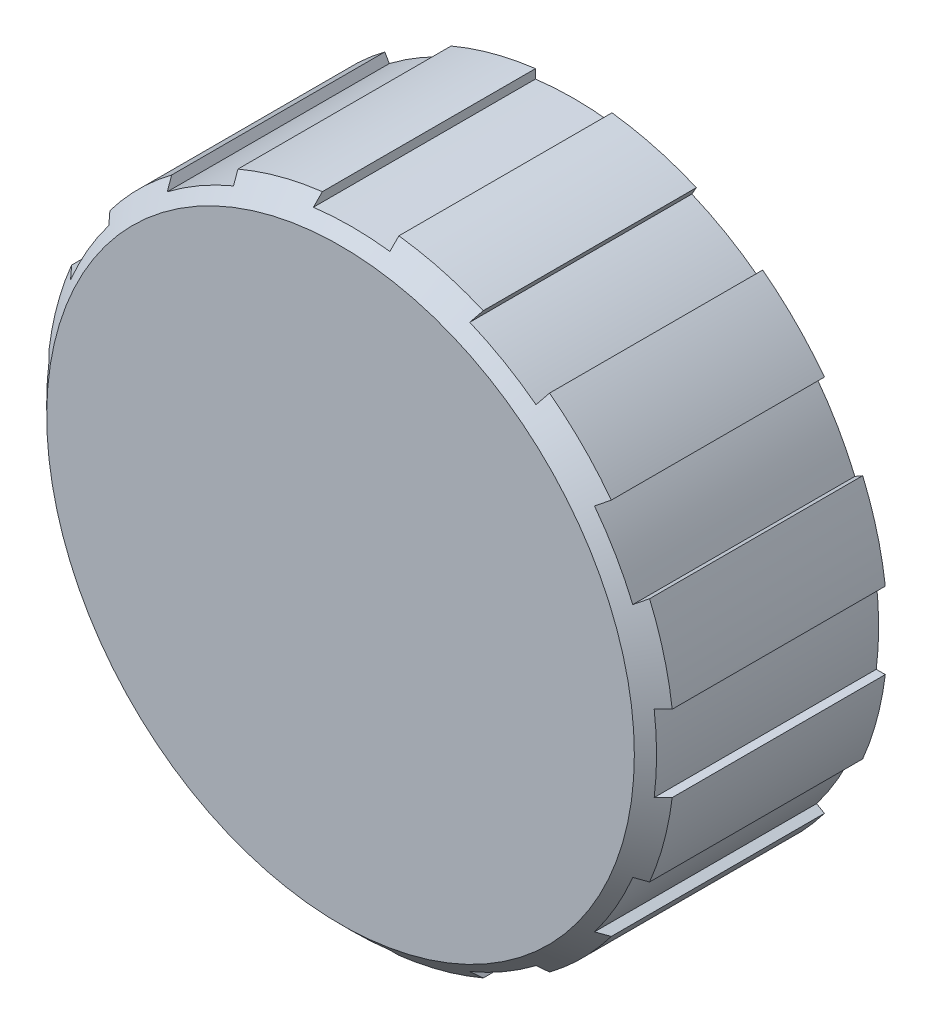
ISO-10303-21;
HEADER;
FILE_DESCRIPTION(('STEP AP214'),'2;1');
FILE_NAME('part.step','',(''),(''),'','','');
FILE_SCHEMA(('AUTOMOTIVE_DESIGN { 1 0 10303 214 1 1 1 1 }'));
ENDSEC;
DATA;
#1=APPLICATION_CONTEXT('core data for automotive mechanical design processes');
#2=APPLICATION_PROTOCOL_DEFINITION('international standard','automotive_design',2000,#1);
#3=PRODUCT_CONTEXT('',#1,'mechanical');
#4=PRODUCT('Part','Part','',(#3));
#5=PRODUCT_RELATED_PRODUCT_CATEGORY('part','',(#4));
#6=PRODUCT_DEFINITION_FORMATION('','',#4);
#7=PRODUCT_DEFINITION_CONTEXT('part definition',#1,'design');
#8=PRODUCT_DEFINITION('design','',#6,#7);
#9=PRODUCT_DEFINITION_SHAPE('','',#8);
#10=(LENGTH_UNIT() NAMED_UNIT(*) SI_UNIT(.MILLI.,.METRE.));
#11=(NAMED_UNIT(*) PLANE_ANGLE_UNIT() SI_UNIT($,.RADIAN.));
#12=(NAMED_UNIT(*) SI_UNIT($,.STERADIAN.) SOLID_ANGLE_UNIT());
#13=UNCERTAINTY_MEASURE_WITH_UNIT(LENGTH_MEASURE(1.E-05),#10,'distance_accuracy_value','');
#14=(GEOMETRIC_REPRESENTATION_CONTEXT(3) GLOBAL_UNCERTAINTY_ASSIGNED_CONTEXT((#13)) GLOBAL_UNIT_ASSIGNED_CONTEXT((#10,
#11,#12)) REPRESENTATION_CONTEXT('',''));
#15=CARTESIAN_POINT('',(0.,0.,0.));
#16=DIRECTION('',(0.,0.,1.));
#17=DIRECTION('',(1.,0.,0.));
#18=AXIS2_PLACEMENT_3D('',#15,#16,#17);
#19=CARTESIAN_POINT('',(0.,0.,26.));
#20=DIRECTION('',(0.,0.,1.));
#21=DIRECTION('',(1.,0.,0.));
#22=AXIS2_PLACEMENT_3D('',#19,#20,#21);
#23=CYLINDRICAL_SURFACE('',#22,35.);
#24=CARTESIAN_POINT('',(0.,0.,23.76));
#25=DIRECTION('',(0.,0.,1.));
#26=DIRECTION('',(1.,0.,0.));
#27=AXIS2_PLACEMENT_3D('',#24,#25,#26);
#28=CIRCLE('',#27,35.);
#29=CARTESIAN_POINT('',(-34.7391153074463,-4.26542701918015,23.7600000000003));
#30=VERTEX_POINT('',#29);
#31=CARTESIAN_POINT('',(-32.2176698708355,-13.6755894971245,23.7600000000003));
#32=VERTEX_POINT('',#31);
#33=EDGE_CURVE('E343',#30,#32,#28,.T.);
#34=ORIENTED_EDGE('',*,*,#33,.F.);
#35=DIRECTION('',(0.,0.,-1.));
#36=VECTOR('',#35,1.);
#37=CARTESIAN_POINT('',(-34.7391153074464,-4.26542701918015,42.));
#38=LINE('',#37,#36);
#39=CARTESIAN_POINT('',(-34.7391153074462,-4.26542701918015,-1.21290972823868E-13));
#40=VERTEX_POINT('',#39);
#41=EDGE_CURVE('E325',#30,#40,#38,.T.);
#42=ORIENTED_EDGE('',*,*,#41,.T.);
#43=CARTESIAN_POINT('',(0.,0.,0.));
#44=DIRECTION('',(0.,0.,1.));
#45=DIRECTION('',(1.,0.,0.));
#46=AXIS2_PLACEMENT_3D('',#43,#44,#45);
#47=CIRCLE('',#46,35.);
#48=CARTESIAN_POINT('',(-32.2176698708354,-13.6755894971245,-1.1248739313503E-13));
#49=VERTEX_POINT('',#48);
#50=EDGE_CURVE('E444',#40,#49,#47,.T.);
#51=ORIENTED_EDGE('',*,*,#50,.T.);
#52=DIRECTION('',(0.,0.,-1.));
#53=VECTOR('',#52,1.);
#54=CARTESIAN_POINT('',(-32.2176698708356,-13.6755894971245,42.));
#55=LINE('',#54,#53);
#56=EDGE_CURVE('E335',#32,#49,#55,.T.);
#57=ORIENTED_EDGE('',*,*,#56,.F.);
#58=EDGE_LOOP('',(#34,#42,#51,#57));
#59=FACE_BOUND('',#58,.T.);
#60=ADVANCED_FACE('F15',(#59),#23,.T.);
#61=CARTESIAN_POINT('',(-32.2176698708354,13.6755894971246,-1.1248739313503E-13));
#62=VERTEX_POINT('',#61);
#63=CARTESIAN_POINT('',(-34.7391153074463,4.26542701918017,-1.21290972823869E-13));
#64=VERTEX_POINT('',#63);
#65=EDGE_CURVE('E446',#62,#64,#47,.T.);
#66=ORIENTED_EDGE('',*,*,#65,.T.);
#67=DIRECTION('',(0.,0.,-1.));
#68=VECTOR('',#67,1.);
#69=CARTESIAN_POINT('',(-34.7391153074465,4.26542701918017,42.));
#70=LINE('',#69,#68);
#71=CARTESIAN_POINT('',(-34.7391153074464,4.26542701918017,23.7599999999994));
#72=VERTEX_POINT('',#71);
#73=EDGE_CURVE('E1331',#72,#64,#70,.T.);
#74=ORIENTED_EDGE('',*,*,#73,.F.);
#75=CARTESIAN_POINT('',(-32.2176698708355,13.6755894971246,23.76));
#76=VERTEX_POINT('',#75);
#77=EDGE_CURVE('E346',#76,#72,#28,.T.);
#78=ORIENTED_EDGE('',*,*,#77,.F.);
#79=DIRECTION('',(0.,0.,-1.));
#80=VECTOR('',#79,1.);
#81=CARTESIAN_POINT('',(-32.2176698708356,13.6755894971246,42.));
#82=LINE('',#81,#80);
#83=EDGE_CURVE('E1333',#76,#62,#82,.T.);
#84=ORIENTED_EDGE('',*,*,#83,.T.);
#85=EDGE_LOOP('',(#66,#74,#78,#84));
#86=FACE_BOUND('',#85,.T.);
#87=ADVANCED_FACE('F403',(#86),#23,.T.);
#88=CARTESIAN_POINT('',(-21.0635258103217,27.9522428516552,0.));
#89=VERTEX_POINT('',#88);
#90=CARTESIAN_POINT('',(-27.9522428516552,21.0635258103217,0.));
#91=VERTEX_POINT('',#90);
#92=EDGE_CURVE('E1359',#89,#91,#47,.T.);
#93=ORIENTED_EDGE('',*,*,#92,.T.);
#94=DIRECTION('',(0.,0.,-1.));
#95=VECTOR('',#94,1.);
#96=CARTESIAN_POINT('',(-27.9522428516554,21.0635258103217,42.));
#97=LINE('',#96,#95);
#98=CARTESIAN_POINT('',(-27.9522428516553,21.0635258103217,23.76));
#99=VERTEX_POINT('',#98);
#100=EDGE_CURVE('E1340',#99,#91,#97,.T.);
#101=ORIENTED_EDGE('',*,*,#100,.F.);
#102=CARTESIAN_POINT('',(-21.0635258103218,27.9522428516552,23.76));
#103=VERTEX_POINT('',#102);
#104=EDGE_CURVE('E350',#103,#99,#28,.T.);
#105=ORIENTED_EDGE('',*,*,#104,.F.);
#106=DIRECTION('',(0.,0.,-1.));
#107=VECTOR('',#106,1.);
#108=CARTESIAN_POINT('',(-21.0635258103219,27.9522428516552,42.));
#109=LINE('',#108,#107);
#110=EDGE_CURVE('E1342',#103,#89,#109,.T.);
#111=ORIENTED_EDGE('',*,*,#110,.T.);
#112=EDGE_LOOP('',(#93,#101,#105,#111));
#113=FACE_BOUND('',#112,.T.);
#114=ADVANCED_FACE('F408',(#113),#23,.T.);
#115=CARTESIAN_POINT('',(13.6755894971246,32.2176698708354,0.));
#116=VERTEX_POINT('',#115);
#117=CARTESIAN_POINT('',(4.26542701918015,34.7391153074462,0.));
#118=VERTEX_POINT('',#117);
#119=EDGE_CURVE('E361',#116,#118,#47,.T.);
#120=ORIENTED_EDGE('',*,*,#119,.T.);
#121=DIRECTION('',(0.,0.,-1.));
#122=VECTOR('',#121,1.);
#123=CARTESIAN_POINT('',(4.26542701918,34.7391153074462,42.));
#124=LINE('',#123,#122);
#125=CARTESIAN_POINT('',(4.26542701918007,34.7391153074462,23.76));
#126=VERTEX_POINT('',#125);
#127=EDGE_CURVE('E911',#126,#118,#124,.T.);
#128=ORIENTED_EDGE('',*,*,#127,.F.);
#129=CARTESIAN_POINT('',(13.6755894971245,32.2176698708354,23.76));
#130=VERTEX_POINT('',#129);
#131=EDGE_CURVE('E353',#130,#126,#28,.T.);
#132=ORIENTED_EDGE('',*,*,#131,.F.);
#133=DIRECTION('',(0.,0.,-1.));
#134=VECTOR('',#133,1.);
#135=CARTESIAN_POINT('',(13.6755894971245,32.2176698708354,42.));
#136=LINE('',#135,#134);
#137=EDGE_CURVE('E912',#130,#116,#136,.T.);
#138=ORIENTED_EDGE('',*,*,#137,.T.);
#139=EDGE_LOOP('',(#120,#128,#132,#138));
#140=FACE_BOUND('',#139,.T.);
#141=ADVANCED_FACE('F896',(#140),#23,.T.);
#142=CARTESIAN_POINT('',(27.9522428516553,21.0635258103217,0.));
#143=VERTEX_POINT('',#142);
#144=CARTESIAN_POINT('',(21.0635258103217,27.9522428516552,0.));
#145=VERTEX_POINT('',#144);
#146=EDGE_CURVE('E364',#143,#145,#47,.T.);
#147=ORIENTED_EDGE('',*,*,#146,.T.);
#148=DIRECTION('',(0.,0.,-1.));
#149=VECTOR('',#148,1.);
#150=CARTESIAN_POINT('',(21.0635258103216,27.9522428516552,42.));
#151=LINE('',#150,#149);
#152=CARTESIAN_POINT('',(21.0635258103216,27.9522428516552,23.7600000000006));
#153=VERTEX_POINT('',#152);
#154=EDGE_CURVE('E482',#153,#145,#151,.T.);
#155=ORIENTED_EDGE('',*,*,#154,.F.);
#156=CARTESIAN_POINT('',(27.9522428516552,21.0635258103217,23.76));
#157=VERTEX_POINT('',#156);
#158=EDGE_CURVE('E357',#157,#153,#28,.T.);
#159=ORIENTED_EDGE('',*,*,#158,.F.);
#160=DIRECTION('',(0.,0.,-1.));
#161=VECTOR('',#160,1.);
#162=CARTESIAN_POINT('',(27.9522428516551,21.0635258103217,42.));
#163=LINE('',#162,#161);
#164=EDGE_CURVE('E484',#157,#143,#163,.T.);
#165=ORIENTED_EDGE('',*,*,#164,.T.);
#166=EDGE_LOOP('',(#147,#155,#159,#165));
#167=FACE_BOUND('',#166,.T.);
#168=ADVANCED_FACE('F480',(#167),#23,.T.);
#169=CARTESIAN_POINT('',(34.7391153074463,4.26542701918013,1.21290972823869E-13));
#170=VERTEX_POINT('',#169);
#171=CARTESIAN_POINT('',(32.2176698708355,13.6755894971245,1.12487393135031E-13));
#172=VERTEX_POINT('',#171);
#173=EDGE_CURVE('E465',#170,#172,#47,.T.);
#174=ORIENTED_EDGE('',*,*,#173,.T.);
#175=DIRECTION('',(0.,0.,-1.));
#176=VECTOR('',#175,1.);
#177=CARTESIAN_POINT('',(32.2176698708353,13.6755894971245,42.));
#178=LINE('',#177,#176);
#179=CARTESIAN_POINT('',(32.2176698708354,13.6755894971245,23.76));
#180=VERTEX_POINT('',#179);
#181=EDGE_CURVE('E610',#180,#172,#178,.T.);
#182=ORIENTED_EDGE('',*,*,#181,.F.);
#183=CARTESIAN_POINT('',(34.7391153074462,4.26542701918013,23.76));
#184=VERTEX_POINT('',#183);
#185=EDGE_CURVE('E773',#184,#180,#28,.T.);
#186=ORIENTED_EDGE('',*,*,#185,.F.);
#187=DIRECTION('',(0.,0.,-1.));
#188=VECTOR('',#187,1.);
#189=CARTESIAN_POINT('',(34.7391153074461,4.26542701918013,42.));
#190=LINE('',#189,#188);
#191=EDGE_CURVE('E615',#184,#170,#190,.T.);
#192=ORIENTED_EDGE('',*,*,#191,.T.);
#193=EDGE_LOOP('',(#174,#182,#186,#192));
#194=FACE_BOUND('',#193,.T.);
#195=ADVANCED_FACE('F888',(#194),#23,.T.);
#196=CARTESIAN_POINT('',(32.2176698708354,-13.6755894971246,1.1248739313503E-13));
#197=VERTEX_POINT('',#196);
#198=CARTESIAN_POINT('',(34.7391153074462,-4.2654270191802,1.21290972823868E-13));
#199=VERTEX_POINT('',#198);
#200=EDGE_CURVE('E459',#197,#199,#47,.T.);
#201=ORIENTED_EDGE('',*,*,#200,.T.);
#202=DIRECTION('',(0.,0.,-1.));
#203=VECTOR('',#202,1.);
#204=CARTESIAN_POINT('',(34.7391153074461,-4.2654270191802,42.));
#205=LINE('',#204,#203);
#206=CARTESIAN_POINT('',(34.7391153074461,-4.2654270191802,23.7599999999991));
#207=VERTEX_POINT('',#206);
#208=EDGE_CURVE('E623',#207,#199,#205,.T.);
#209=ORIENTED_EDGE('',*,*,#208,.F.);
#210=CARTESIAN_POINT('',(32.2176698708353,-13.6755894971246,23.76));
#211=VERTEX_POINT('',#210);
#212=EDGE_CURVE('E768',#211,#207,#28,.T.);
#213=ORIENTED_EDGE('',*,*,#212,.F.);
#214=DIRECTION('',(0.,0.,-1.));
#215=VECTOR('',#214,1.);
#216=CARTESIAN_POINT('',(32.2176698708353,-13.6755894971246,42.));
#217=LINE('',#216,#215);
#218=EDGE_CURVE('E625',#211,#197,#217,.T.);
#219=ORIENTED_EDGE('',*,*,#218,.T.);
#220=EDGE_LOOP('',(#201,#209,#213,#219));
#221=FACE_BOUND('',#220,.T.);
#222=ADVANCED_FACE('F883',(#221),#23,.T.);
#223=CARTESIAN_POINT('',(21.0635258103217,-27.9522428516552,0.));
#224=VERTEX_POINT('',#223);
#225=CARTESIAN_POINT('',(27.9522428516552,-21.0635258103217,0.));
#226=VERTEX_POINT('',#225);
#227=EDGE_CURVE('E453',#224,#226,#47,.T.);
#228=ORIENTED_EDGE('',*,*,#227,.T.);
#229=DIRECTION('',(0.,0.,-1.));
#230=VECTOR('',#229,1.);
#231=CARTESIAN_POINT('',(27.9522428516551,-21.0635258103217,42.));
#232=LINE('',#231,#230);
#233=CARTESIAN_POINT('',(27.9522428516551,-21.0635258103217,23.7600000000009));
#234=VERTEX_POINT('',#233);
#235=EDGE_CURVE('E633',#234,#226,#232,.T.);
#236=ORIENTED_EDGE('',*,*,#235,.F.);
#237=CARTESIAN_POINT('',(21.0635258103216,-27.9522428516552,23.76));
#238=VERTEX_POINT('',#237);
#239=EDGE_CURVE('E765',#238,#234,#28,.T.);
#240=ORIENTED_EDGE('',*,*,#239,.F.);
#241=DIRECTION('',(0.,0.,-1.));
#242=VECTOR('',#241,1.);
#243=CARTESIAN_POINT('',(21.0635258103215,-27.9522428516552,42.));
#244=LINE('',#243,#242);
#245=EDGE_CURVE('E635',#238,#224,#244,.T.);
#246=ORIENTED_EDGE('',*,*,#245,.T.);
#247=EDGE_LOOP('',(#228,#236,#240,#246));
#248=FACE_BOUND('',#247,.T.);
#249=ADVANCED_FACE('F895',(#248),#23,.T.);
#250=CARTESIAN_POINT('',(4.26542701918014,-34.7391153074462,0.));
#251=VERTEX_POINT('',#250);
#252=CARTESIAN_POINT('',(13.6755894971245,-32.2176698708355,0.));
#253=VERTEX_POINT('',#252);
#254=EDGE_CURVE('E448',#251,#253,#47,.T.);
#255=ORIENTED_EDGE('',*,*,#254,.T.);
#256=DIRECTION('',(0.,0.,-1.));
#257=VECTOR('',#256,1.);
#258=CARTESIAN_POINT('',(13.6755894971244,-32.2176698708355,42.));
#259=LINE('',#258,#257);
#260=CARTESIAN_POINT('',(13.6755894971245,-32.2176698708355,23.7600000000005));
#261=VERTEX_POINT('',#260);
#262=EDGE_CURVE('E643',#261,#253,#259,.T.);
#263=ORIENTED_EDGE('',*,*,#262,.F.);
#264=CARTESIAN_POINT('',(4.26542701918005,-34.7391153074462,23.76));
#265=VERTEX_POINT('',#264);
#266=EDGE_CURVE('E764',#265,#261,#28,.T.);
#267=ORIENTED_EDGE('',*,*,#266,.F.);
#268=DIRECTION('',(0.,0.,-1.));
#269=VECTOR('',#268,1.);
#270=CARTESIAN_POINT('',(4.26542701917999,-34.7391153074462,42.));
#271=LINE('',#270,#269);
#272=EDGE_CURVE('E645',#265,#251,#271,.T.);
#273=ORIENTED_EDGE('',*,*,#272,.T.);
#274=EDGE_LOOP('',(#255,#263,#267,#273));
#275=FACE_BOUND('',#274,.T.);
#276=ADVANCED_FACE('F432',(#275),#23,.T.);
#277=CARTESIAN_POINT('',(-13.6755894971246,-32.2176698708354,0.));
#278=VERTEX_POINT('',#277);
#279=CARTESIAN_POINT('',(-4.2654270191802,-34.7391153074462,0.));
#280=VERTEX_POINT('',#279);
#281=EDGE_CURVE('E445',#278,#280,#47,.T.);
#282=ORIENTED_EDGE('',*,*,#281,.T.);
#283=DIRECTION('',(0.,0.,-1.));
#284=VECTOR('',#283,1.);
#285=CARTESIAN_POINT('',(-4.26542701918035,-34.7391153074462,42.));
#286=LINE('',#285,#284);
#287=CARTESIAN_POINT('',(-4.26542701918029,-34.7391153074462,23.7600000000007));
#288=VERTEX_POINT('',#287);
#289=EDGE_CURVE('E653',#288,#280,#286,.T.);
#290=ORIENTED_EDGE('',*,*,#289,.F.);
#291=CARTESIAN_POINT('',(-13.6755894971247,-32.2176698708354,23.76));
#292=VERTEX_POINT('',#291);
#293=EDGE_CURVE('E352',#292,#288,#28,.T.);
#294=ORIENTED_EDGE('',*,*,#293,.F.);
#295=DIRECTION('',(0.,0.,-1.));
#296=VECTOR('',#295,1.);
#297=CARTESIAN_POINT('',(-13.6755894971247,-32.2176698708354,42.));
#298=LINE('',#297,#296);
#299=EDGE_CURVE('E655',#292,#278,#298,.T.);
#300=ORIENTED_EDGE('',*,*,#299,.T.);
#301=EDGE_LOOP('',(#282,#290,#294,#300));
#302=FACE_BOUND('',#301,.T.);
#303=ADVANCED_FACE('F424',(#302),#23,.T.);
#304=CARTESIAN_POINT('',(-27.9522428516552,-21.0635258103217,0.));
#305=VERTEX_POINT('',#304);
#306=CARTESIAN_POINT('',(-21.0635258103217,-27.9522428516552,0.));
#307=VERTEX_POINT('',#306);
#308=EDGE_CURVE('E438',#305,#307,#47,.T.);
#309=ORIENTED_EDGE('',*,*,#308,.T.);
#310=DIRECTION('',(0.,0.,-1.));
#311=VECTOR('',#310,1.);
#312=CARTESIAN_POINT('',(-21.0635258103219,-27.9522428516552,42.));
#313=LINE('',#312,#311);
#314=CARTESIAN_POINT('',(-21.0635258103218,-27.9522428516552,23.7600000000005));
#315=VERTEX_POINT('',#314);
#316=EDGE_CURVE('E440',#315,#307,#313,.T.);
#317=ORIENTED_EDGE('',*,*,#316,.F.);
#318=CARTESIAN_POINT('',(-27.9522428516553,-21.0635258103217,23.76));
#319=VERTEX_POINT('',#318);
#320=EDGE_CURVE('E347',#319,#315,#28,.T.);
#321=ORIENTED_EDGE('',*,*,#320,.F.);
#322=DIRECTION('',(0.,0.,-1.));
#323=VECTOR('',#322,1.);
#324=CARTESIAN_POINT('',(-27.9522428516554,-21.0635258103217,42.));
#325=LINE('',#324,#323);
#326=EDGE_CURVE('E441',#319,#305,#325,.T.);
#327=ORIENTED_EDGE('',*,*,#326,.T.);
#328=EDGE_LOOP('',(#309,#317,#321,#327));
#329=FACE_BOUND('',#328,.T.);
#330=ADVANCED_FACE('F414',(#329),#23,.T.);
#331=CARTESIAN_POINT('',(0.,29.807,2.));
#332=DIRECTION('',(0.,0.,1.));
#333=DIRECTION('',(1.,0.,0.));
#334=AXIS2_PLACEMENT_3D('',#331,#332,#333);
#335=PLANE('',#334);
#336=CARTESIAN_POINT('',(0.,0.,2.));
#337=DIRECTION('',(0.,0.,1.));
#338=DIRECTION('',(1.,0.,0.));
#339=AXIS2_PLACEMENT_3D('',#336,#337,#338);
#340=CIRCLE('',#339,30.307);
#341=CARTESIAN_POINT('',(30.307,0.,2.00000000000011));
#342=VERTEX_POINT('',#341);
#343=EDGE_CURVE('E369',#342,#342,#340,.T.);
#344=ORIENTED_EDGE('',*,*,#343,.F.);
#345=EDGE_LOOP('',(#344));
#346=FACE_BOUND('',#345,.T.);
#347=CARTESIAN_POINT('',(0.,0.,2.));
#348=DIRECTION('',(0.,0.,-1.));
#349=DIRECTION('',(-1.,0.,0.));
#350=AXIS2_PLACEMENT_3D('',#347,#348,#349);
#351=CIRCLE('',#350,29.807);
#352=CARTESIAN_POINT('',(-29.807,0.,1.9999999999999));
#353=VERTEX_POINT('',#352);
#354=EDGE_CURVE('E1325',#353,#353,#351,.T.);
#355=ORIENTED_EDGE('',*,*,#354,.F.);
#356=EDGE_LOOP('',(#355));
#357=FACE_BOUND('',#356,.T.);
#358=ADVANCED_FACE('F423',(#346,#357),#335,.F.);
#359=CARTESIAN_POINT('',(0.,0.,26.));
#360=DIRECTION('',(0.,0.,1.));
#361=DIRECTION('',(1.,0.,0.));
#362=AXIS2_PLACEMENT_3D('',#359,#360,#361);
#363=CYLINDRICAL_SURFACE('',#362,30.307);
#364=CARTESIAN_POINT('',(0.,0.,0.));
#365=DIRECTION('',(0.,0.,1.));
#366=DIRECTION('',(1.,0.,0.));
#367=AXIS2_PLACEMENT_3D('',#364,#365,#366);
#368=CIRCLE('',#367,30.307);
#369=CARTESIAN_POINT('',(30.307,0.,1.05816324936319E-13));
#370=VERTEX_POINT('',#369);
#371=EDGE_CURVE('E366',#370,#370,#368,.T.);
#372=ORIENTED_EDGE('',*,*,#371,.F.);
#373=EDGE_LOOP('',(#372));
#374=FACE_BOUND('',#373,.T.);
#375=ORIENTED_EDGE('',*,*,#343,.T.);
#376=EDGE_LOOP('',(#375));
#377=FACE_BOUND('',#376,.T.);
#378=ADVANCED_FACE('F419',(#374,#377),#363,.F.);
#379=CARTESIAN_POINT('',(0.,30.307,0.));
#380=DIRECTION('',(0.,0.,1.));
#381=DIRECTION('',(1.,0.,0.));
#382=AXIS2_PLACEMENT_3D('',#379,#380,#381);
#383=PLANE('',#382);
#384=CARTESIAN_POINT('',(0.,1.94289029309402E-13,0.));
#385=DIRECTION('',(0.,0.,1.));
#386=DIRECTION('',(1.,0.,0.));
#387=AXIS2_PLACEMENT_3D('',#384,#385,#386);
#388=CIRCLE('',#387,34.);
#389=CARTESIAN_POINT('',(-4.26542701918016,33.7313820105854,0.));
#390=VERTEX_POINT('',#389);
#391=CARTESIAN_POINT('',(4.26542701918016,33.7313820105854,0.));
#392=VERTEX_POINT('',#391);
#393=EDGE_CURVE('E507',#390,#392,#388,.F.);
#394=ORIENTED_EDGE('',*,*,#393,.T.);
#395=DIRECTION('',(0.,1.,0.));
#396=VECTOR('',#395,1.);
#397=CARTESIAN_POINT('',(4.26542701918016,30.307,0.));
#398=LINE('',#397,#396);
#399=EDGE_CURVE('E504',#392,#118,#398,.T.);
#400=ORIENTED_EDGE('',*,*,#399,.T.);
#401=ORIENTED_EDGE('',*,*,#119,.F.);
#402=DIRECTION('',(-0.5,-0.866025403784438,0.));
#403=VECTOR('',#402,1.);
#404=CARTESIAN_POINT('',(9.42934779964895,24.8629635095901,0.));
#405=LINE('',#404,#403);
#406=CARTESIAN_POINT('',(13.1717228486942,31.3449472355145,0.));
#407=VERTEX_POINT('',#406);
#408=EDGE_CURVE('E497',#116,#407,#405,.T.);
#409=ORIENTED_EDGE('',*,*,#408,.T.);
#410=CARTESIAN_POINT('',(-2.84494650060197E-13,-4.5102810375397E-13,0.));
#411=DIRECTION('',(0.,0.,1.));
#412=DIRECTION('',(1.,0.,0.));
#413=AXIS2_PLACEMENT_3D('',#410,#411,#412);
#414=CIRCLE('',#413,34.0000000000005);
#415=CARTESIAN_POINT('',(20.5596591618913,27.0795202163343,0.));
#416=VERTEX_POINT('',#415);
#417=EDGE_CURVE('E493',#407,#416,#414,.F.);
#418=ORIENTED_EDGE('',*,*,#417,.T.);
#419=DIRECTION('',(0.500000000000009,0.866025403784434,0.));
#420=VECTOR('',#419,1.);
#421=CARTESIAN_POINT('',(16.8172841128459,20.5975364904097,0.));
#422=LINE('',#421,#420);
#423=EDGE_CURVE('E491',#416,#145,#422,.T.);
#424=ORIENTED_EDGE('',*,*,#423,.T.);
#425=ORIENTED_EDGE('',*,*,#146,.F.);
#426=DIRECTION('',(-0.866025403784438,-0.5,0.));
#427=VECTOR('',#426,1.);
#428=CARTESIAN_POINT('',(10.9906024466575,11.2707181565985,0.));
#429=LINE('',#428,#427);
#430=CARTESIAN_POINT('',(27.0795202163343,20.5596591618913,0.));
#431=VERTEX_POINT('',#430);
#432=EDGE_CURVE('E489',#143,#431,#429,.T.);
#433=ORIENTED_EDGE('',*,*,#432,.T.);
#434=CARTESIAN_POINT('',(0.,0.,0.));
#435=DIRECTION('',(0.,0.,1.));
#436=DIRECTION('',(1.,0.,0.));
#437=AXIS2_PLACEMENT_3D('',#434,#435,#436);
#438=CIRCLE('',#437,34.);
#439=CARTESIAN_POINT('',(31.3449472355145,13.1717228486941,1.09440298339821E-13));
#440=VERTEX_POINT('',#439);
#441=EDGE_CURVE('E499',#431,#440,#438,.F.);
#442=ORIENTED_EDGE('',*,*,#441,.T.);
#443=DIRECTION('',(0.86602540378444,0.5,0.));
#444=VECTOR('',#443,1.);
#445=CARTESIAN_POINT('',(15.2560294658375,3.88278184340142,0.));
#446=LINE('',#445,#444);
#447=EDGE_CURVE('E593',#440,#172,#446,.T.);
#448=ORIENTED_EDGE('',*,*,#447,.T.);
#449=ORIENTED_EDGE('',*,*,#173,.F.);
#450=DIRECTION('',(-1.,0.,0.));
#451=VECTOR('',#450,1.);
#452=CARTESIAN_POINT('',(0.,4.26542701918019,0.));
#453=LINE('',#452,#451);
#454=CARTESIAN_POINT('',(33.7313820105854,4.26542701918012,1.17772490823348E-13));
#455=VERTEX_POINT('',#454);
#456=EDGE_CURVE('E590',#170,#455,#453,.T.);
#457=ORIENTED_EDGE('',*,*,#456,.T.);
#458=CARTESIAN_POINT('',(6.31439345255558E-13,0.,0.));
#459=DIRECTION('',(0.,0.,1.));
#460=DIRECTION('',(1.,0.,0.));
#461=AXIS2_PLACEMENT_3D('',#458,#459,#460);
#462=CIRCLE('',#461,33.9999999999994);
#463=CARTESIAN_POINT('',(33.7313820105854,-4.26542701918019,1.17772490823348E-13));
#464=VERTEX_POINT('',#463);
#465=EDGE_CURVE('E587',#455,#464,#462,.F.);
#466=ORIENTED_EDGE('',*,*,#465,.T.);
#467=DIRECTION('',(1.,0.,0.));
#468=VECTOR('',#467,1.);
#469=CARTESIAN_POINT('',(-2.38053464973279E-13,-4.26542701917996,0.));
#470=LINE('',#469,#468);
#471=EDGE_CURVE('E584',#464,#199,#470,.T.);
#472=ORIENTED_EDGE('',*,*,#471,.T.);
#473=ORIENTED_EDGE('',*,*,#200,.F.);
#474=DIRECTION('',(-0.866025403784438,0.5,0.));
#475=VECTOR('',#474,1.);
#476=CARTESIAN_POINT('',(-10.9906024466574,11.2707181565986,0.));
#477=LINE('',#476,#475);
#478=CARTESIAN_POINT('',(31.3449472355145,-13.1717228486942,1.09440298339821E-13));
#479=VERTEX_POINT('',#478);
#480=EDGE_CURVE('E581',#197,#479,#477,.T.);
#481=ORIENTED_EDGE('',*,*,#480,.T.);
#482=CARTESIAN_POINT('',(0.,0.,0.));
#483=DIRECTION('',(0.,0.,1.));
#484=DIRECTION('',(1.,0.,0.));
#485=AXIS2_PLACEMENT_3D('',#482,#483,#484);
#486=CIRCLE('',#485,34.);
#487=CARTESIAN_POINT('',(27.0795202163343,-20.5596591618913,0.));
#488=VERTEX_POINT('',#487);
#489=EDGE_CURVE('E578',#479,#488,#486,.F.);
#490=ORIENTED_EDGE('',*,*,#489,.T.);
#491=DIRECTION('',(0.866025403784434,-0.500000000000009,0.));
#492=VECTOR('',#491,1.);
#493=CARTESIAN_POINT('',(-15.2560294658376,3.88278184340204,0.));
#494=LINE('',#493,#492);
#495=EDGE_CURVE('E575',#488,#226,#494,.T.);
#496=ORIENTED_EDGE('',*,*,#495,.T.);
#497=ORIENTED_EDGE('',*,*,#227,.F.);
#498=DIRECTION('',(-0.499999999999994,0.866025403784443,0.));
#499=VECTOR('',#498,1.);
#500=CARTESIAN_POINT('',(-9.42934779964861,24.8629635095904,0.));
#501=LINE('',#500,#499);
#502=CARTESIAN_POINT('',(20.5596591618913,-27.0795202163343,0.));
#503=VERTEX_POINT('',#502);
#504=EDGE_CURVE('E572',#224,#503,#501,.T.);
#505=ORIENTED_EDGE('',*,*,#504,.T.);
#506=CARTESIAN_POINT('',(0.,0.,0.));
#507=DIRECTION('',(0.,0.,1.));
#508=DIRECTION('',(1.,0.,0.));
#509=AXIS2_PLACEMENT_3D('',#506,#507,#508);
#510=CIRCLE('',#509,34.);
#511=CARTESIAN_POINT('',(13.1717228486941,-31.3449472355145,0.));
#512=VERTEX_POINT('',#511);
#513=EDGE_CURVE('E569',#503,#512,#510,.F.);
#514=ORIENTED_EDGE('',*,*,#513,.T.);
#515=DIRECTION('',(0.5,-0.866025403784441,0.));
#516=VECTOR('',#515,1.);
#517=CARTESIAN_POINT('',(-16.8172841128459,20.5975364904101,0.));
#518=LINE('',#517,#516);
#519=EDGE_CURVE('E566',#512,#253,#518,.T.);
#520=ORIENTED_EDGE('',*,*,#519,.T.);
#521=ORIENTED_EDGE('',*,*,#254,.F.);
#522=DIRECTION('',(0.,1.,0.));
#523=VECTOR('',#522,1.);
#524=CARTESIAN_POINT('',(4.26542701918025,30.307,0.));
#525=LINE('',#524,#523);
#526=CARTESIAN_POINT('',(4.26542701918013,-33.7313820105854,0.));
#527=VERTEX_POINT('',#526);
#528=EDGE_CURVE('E563',#251,#527,#525,.T.);
#529=ORIENTED_EDGE('',*,*,#528,.T.);
#530=CARTESIAN_POINT('',(0.,-6.17561557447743E-13,0.));
#531=DIRECTION('',(0.,0.,1.));
#532=DIRECTION('',(1.,0.,0.));
#533=AXIS2_PLACEMENT_3D('',#530,#531,#532);
#534=CIRCLE('',#533,33.9999999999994);
#535=CARTESIAN_POINT('',(-4.26542701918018,-33.7313820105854,0.));
#536=VERTEX_POINT('',#535);
#537=EDGE_CURVE('E560',#527,#536,#534,.F.);
#538=ORIENTED_EDGE('',*,*,#537,.T.);
#539=DIRECTION('',(0.,-1.,0.));
#540=VECTOR('',#539,1.);
#541=CARTESIAN_POINT('',(-4.2654270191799,30.307,0.));
#542=LINE('',#541,#540);
#543=EDGE_CURVE('E557',#536,#280,#542,.T.);
#544=ORIENTED_EDGE('',*,*,#543,.T.);
#545=ORIENTED_EDGE('',*,*,#281,.F.);
#546=DIRECTION('',(0.5,0.86602540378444,0.));
#547=VECTOR('',#546,1.);
#548=CARTESIAN_POINT('',(16.817284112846,20.5975364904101,0.));
#549=LINE('',#548,#547);
#550=CARTESIAN_POINT('',(-13.1717228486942,-31.3449472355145,0.));
#551=VERTEX_POINT('',#550);
#552=EDGE_CURVE('E554',#278,#551,#549,.T.);
#553=ORIENTED_EDGE('',*,*,#552,.T.);
#554=CARTESIAN_POINT('',(-1.14491749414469E-13,-2.25514051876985E-13,0.));
#555=DIRECTION('',(0.,0.,1.));
#556=DIRECTION('',(1.,0.,0.));
#557=AXIS2_PLACEMENT_3D('',#554,#555,#556);
#558=CIRCLE('',#557,34.);
#559=CARTESIAN_POINT('',(-20.5596591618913,-27.0795202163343,0.));
#560=VERTEX_POINT('',#559);
#561=EDGE_CURVE('E551',#551,#560,#558,.F.);
#562=ORIENTED_EDGE('',*,*,#561,.T.);
#563=DIRECTION('',(-0.5,-0.866025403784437,0.));
#564=VECTOR('',#563,1.);
#565=CARTESIAN_POINT('',(9.42934779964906,24.86296350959,0.));
#566=LINE('',#565,#564);
#567=EDGE_CURVE('E549',#560,#307,#566,.T.);
#568=ORIENTED_EDGE('',*,*,#567,.T.);
#569=ORIENTED_EDGE('',*,*,#308,.F.);
#570=DIRECTION('',(0.86602540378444,0.5,0.));
#571=VECTOR('',#570,1.);
#572=CARTESIAN_POINT('',(15.2560294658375,3.88278184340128,0.));
#573=LINE('',#572,#571);
#574=CARTESIAN_POINT('',(-27.0795202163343,-20.5596591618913,0.));
#575=VERTEX_POINT('',#574);
#576=EDGE_CURVE('E543',#305,#575,#573,.T.);
#577=ORIENTED_EDGE('',*,*,#576,.T.);
#578=CARTESIAN_POINT('',(1.80411241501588E-13,1.38777878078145E-13,0.));
#579=DIRECTION('',(0.,0.,1.));
#580=DIRECTION('',(1.,0.,0.));
#581=AXIS2_PLACEMENT_3D('',#578,#579,#580);
#582=CIRCLE('',#581,34.);
#583=CARTESIAN_POINT('',(-31.3449472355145,-13.1717228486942,-1.09440298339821E-13));
#584=VERTEX_POINT('',#583);
#585=EDGE_CURVE('E539',#575,#584,#582,.F.);
#586=ORIENTED_EDGE('',*,*,#585,.T.);
#587=DIRECTION('',(-0.866025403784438,-0.5,0.));
#588=VECTOR('',#587,1.);
#589=CARTESIAN_POINT('',(10.9906024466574,11.2707181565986,0.));
#590=LINE('',#589,#588);
#591=EDGE_CURVE('E538',#584,#49,#590,.T.);
#592=ORIENTED_EDGE('',*,*,#591,.T.);
#593=ORIENTED_EDGE('',*,*,#50,.F.);
#594=DIRECTION('',(1.,0.,0.));
#595=VECTOR('',#594,1.);
#596=CARTESIAN_POINT('',(0.,-4.26542701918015,0.));
#597=LINE('',#596,#595);
#598=CARTESIAN_POINT('',(-33.7313820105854,-4.26542701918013,-1.17772490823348E-13));
#599=VERTEX_POINT('',#598);
#600=EDGE_CURVE('E330',#40,#599,#597,.T.);
#601=ORIENTED_EDGE('',*,*,#600,.T.);
#602=CARTESIAN_POINT('',(-5.96744875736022E-13,0.,0.));
#603=DIRECTION('',(0.,0.,1.));
#604=DIRECTION('',(1.,0.,0.));
#605=AXIS2_PLACEMENT_3D('',#602,#603,#604);
#606=CIRCLE('',#605,33.9999999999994);
#607=CARTESIAN_POINT('',(-33.7313820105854,4.26542701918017,-1.17772490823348E-13));
#608=VERTEX_POINT('',#607);
#609=EDGE_CURVE('E533',#599,#608,#606,.F.);
#610=ORIENTED_EDGE('',*,*,#609,.T.);
#611=DIRECTION('',(-1.,0.,0.));
#612=VECTOR('',#611,1.);
#613=CARTESIAN_POINT('',(0.,4.26542701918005,0.));
#614=LINE('',#613,#612);
#615=EDGE_CURVE('E530',#608,#64,#614,.T.);
#616=ORIENTED_EDGE('',*,*,#615,.T.);
#617=ORIENTED_EDGE('',*,*,#65,.F.);
#618=DIRECTION('',(0.866025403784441,-0.5,0.));
#619=VECTOR('',#618,1.);
#620=CARTESIAN_POINT('',(-15.2560294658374,3.88278184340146,0.));
#621=LINE('',#620,#619);
#622=CARTESIAN_POINT('',(-31.3449472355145,13.1717228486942,-1.09440298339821E-13));
#623=VERTEX_POINT('',#622);
#624=EDGE_CURVE('E527',#62,#623,#621,.T.);
#625=ORIENTED_EDGE('',*,*,#624,.T.);
#626=CARTESIAN_POINT('',(5.58580959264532E-13,-3.19189119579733E-13,0.));
#627=DIRECTION('',(0.,0.,1.));
#628=DIRECTION('',(1.,0.,0.));
#629=AXIS2_PLACEMENT_3D('',#626,#627,#628);
#630=CIRCLE('',#629,34.0000000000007);
#631=CARTESIAN_POINT('',(-27.0795202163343,20.5596591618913,0.));
#632=VERTEX_POINT('',#631);
#633=EDGE_CURVE('E524',#623,#632,#630,.F.);
#634=ORIENTED_EDGE('',*,*,#633,.T.);
#635=DIRECTION('',(-0.866025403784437,0.5,0.));
#636=VECTOR('',#635,1.);
#637=CARTESIAN_POINT('',(-10.9906024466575,11.2707181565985,0.));
#638=LINE('',#637,#636);
#639=EDGE_CURVE('E521',#632,#91,#638,.T.);
#640=ORIENTED_EDGE('',*,*,#639,.T.);
#641=ORIENTED_EDGE('',*,*,#92,.F.);
#642=DIRECTION('',(0.5,-0.866025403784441,0.));
#643=VECTOR('',#642,1.);
#644=CARTESIAN_POINT('',(-16.8172841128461,20.5975364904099,0.));
#645=LINE('',#644,#643);
#646=CARTESIAN_POINT('',(-20.5596591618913,27.0795202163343,0.));
#647=VERTEX_POINT('',#646);
#648=EDGE_CURVE('E518',#89,#647,#645,.T.);
#649=ORIENTED_EDGE('',*,*,#648,.T.);
#650=CARTESIAN_POINT('',(0.,-1.56125112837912E-13,0.));
#651=DIRECTION('',(0.,0.,1.));
#652=DIRECTION('',(1.,0.,0.));
#653=AXIS2_PLACEMENT_3D('',#650,#651,#652);
#654=CIRCLE('',#653,34.);
#655=CARTESIAN_POINT('',(-13.1717228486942,31.3449472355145,0.));
#656=VERTEX_POINT('',#655);
#657=EDGE_CURVE('E515',#647,#656,#654,.F.);
#658=ORIENTED_EDGE('',*,*,#657,.T.);
#659=DIRECTION('',(-0.5,0.866025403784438,0.));
#660=VECTOR('',#659,1.);
#661=CARTESIAN_POINT('',(-9.42934779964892,24.8629635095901,0.));
#662=LINE('',#661,#660);
#663=CARTESIAN_POINT('',(-13.6755894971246,32.2176698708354,0.));
#664=VERTEX_POINT('',#663);
#665=EDGE_CURVE('E512',#656,#664,#662,.T.);
#666=ORIENTED_EDGE('',*,*,#665,.T.);
#667=CARTESIAN_POINT('',(-4.26542701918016,34.7391153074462,0.));
#668=VERTEX_POINT('',#667);
#669=EDGE_CURVE('E365',#668,#664,#47,.T.);
#670=ORIENTED_EDGE('',*,*,#669,.F.);
#671=DIRECTION('',(0.,-1.,0.));
#672=VECTOR('',#671,1.);
#673=CARTESIAN_POINT('',(-4.26542701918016,30.307,0.));
#674=LINE('',#673,#672);
#675=EDGE_CURVE('E509',#668,#390,#674,.T.);
#676=ORIENTED_EDGE('',*,*,#675,.T.);
#677=EDGE_LOOP('',(#394,#400,#401,#409,#418,#424,#425,#433,#442,#448,#449,#457,#466,#472,#473,
#481,#490,#496,#497,#505,#514,#520,#521,#529,#538,#544,#545,#553,#562,#568,#569,#577,#586,#592,
#593,#601,#610,#616,#617,#625,#634,#640,#641,#649,#658,#666,#670,#676));
#678=FACE_BOUND('',#677,.T.);
#679=ORIENTED_EDGE('',*,*,#371,.T.);
#680=EDGE_LOOP('',(#679));
#681=FACE_BOUND('',#680,.T.);
#682=ADVANCED_FACE('F412',(#678,#681),#383,.F.);
#683=ORIENTED_EDGE('',*,*,#669,.T.);
#684=DIRECTION('',(0.,0.,-1.));
#685=VECTOR('',#684,1.);
#686=CARTESIAN_POINT('',(-13.6755894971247,32.2176698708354,42.));
#687=LINE('',#686,#685);
#688=CARTESIAN_POINT('',(-13.6755894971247,32.2176698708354,23.7600000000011));
#689=VERTEX_POINT('',#688);
#690=EDGE_CURVE('E1351',#689,#664,#687,.T.);
#691=ORIENTED_EDGE('',*,*,#690,.F.);
#692=CARTESIAN_POINT('',(-4.26542701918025,34.7391153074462,23.76));
#693=VERTEX_POINT('',#692);
#694=EDGE_CURVE('E359',#693,#689,#28,.T.);
#695=ORIENTED_EDGE('',*,*,#694,.F.);
#696=DIRECTION('',(0.,0.,-1.));
#697=VECTOR('',#696,1.);
#698=CARTESIAN_POINT('',(-4.26542701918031,34.7391153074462,42.));
#699=LINE('',#698,#697);
#700=EDGE_CURVE('E927',#693,#668,#699,.T.);
#701=ORIENTED_EDGE('',*,*,#700,.T.);
#702=EDGE_LOOP('',(#683,#691,#695,#701));
#703=FACE_BOUND('',#702,.T.);
#704=ADVANCED_FACE('F399',(#703),#23,.T.);
#705=CARTESIAN_POINT('',(0.,0.,23.76));
#706=DIRECTION('',(0.,0.,-1.));
#707=DIRECTION('',(-1.,0.,0.));
#708=AXIS2_PLACEMENT_3D('',#705,#706,#707);
#709=CONICAL_SURFACE('',#708,35.,0.785398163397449);
#710=CARTESIAN_POINT('',(0.,0.,26.));
#711=DIRECTION('',(0.,0.,1.));
#712=DIRECTION('',(1.,0.,0.));
#713=AXIS2_PLACEMENT_3D('',#710,#711,#712);
#714=CIRCLE('',#713,32.76);
#715=CARTESIAN_POINT('',(32.7599999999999,0.,26.0000000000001));
#716=VERTEX_POINT('',#715);
#717=EDGE_CURVE('E358',#716,#716,#714,.T.);
#718=ORIENTED_EDGE('',*,*,#717,.F.);
#719=EDGE_LOOP('',(#718));
#720=FACE_BOUND('',#719,.T.);
#721=CARTESIAN_POINT('',(0.,0.,24.7600000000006));
#722=DIRECTION('',(0.,0.,-1.));
#723=DIRECTION('',(-1.,0.,0.));
#724=AXIS2_PLACEMENT_3D('',#721,#722,#723);
#725=CIRCLE('',#724,33.9999999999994);
#726=CARTESIAN_POINT('',(-33.7313820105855,4.26542701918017,24.76));
#727=VERTEX_POINT('',#726);
#728=CARTESIAN_POINT('',(-33.7313820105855,-4.26542701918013,24.7600000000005));
#729=VERTEX_POINT('',#728);
#730=EDGE_CURVE('E29',#727,#729,#725,.F.);
#731=ORIENTED_EDGE('',*,*,#730,.T.);
#732=CARTESIAN_POINT('',(-31.2749396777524,-4.26542701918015,27.1955307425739));
#733=CARTESIAN_POINT('',(-31.768680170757,-4.26542701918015,26.7063176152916));
#734=CARTESIAN_POINT('',(-32.2623164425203,-4.26542701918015,26.2169993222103));
#735=CARTESIAN_POINT('',(-33.2494041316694,-4.26542701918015,25.2381764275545));
#736=CARTESIAN_POINT('',(-33.7428555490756,-4.26542701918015,24.7486718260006));
#737=CARTESIAN_POINT('',(-34.7295972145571,-4.26542701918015,23.7695002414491));
#738=CARTESIAN_POINT('',(-35.2228874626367,-4.26542701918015,23.2798332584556));
#739=CARTESIAN_POINT('',(-36.2093251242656,-4.26542701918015,22.3003553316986));
#740=CARTESIAN_POINT('',(-36.7024725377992,-4.26542701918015,21.810544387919));
#741=CARTESIAN_POINT('',(-37.1955576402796,-4.26542701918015,21.32067073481));
#742=B_SPLINE_CURVE_WITH_KNOTS('',3,(#732,#733,#734,#735,#736,#737,#738,#739,#740,#741),
.UNSPECIFIED.,.F.,.F.,(4,2,2,2,4),(0.,2.08518159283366,4.17036295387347,6.25554426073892,
8.34072579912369),.UNSPECIFIED.);
#743=EDGE_CURVE('E10',#729,#30,#742,.T.);
#744=ORIENTED_EDGE('',*,*,#743,.T.);
#745=ORIENTED_EDGE('',*,*,#33,.T.);
#746=CARTESIAN_POINT('',(-32.2178443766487,-13.6756902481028,23.7598));
#747=CARTESIAN_POINT('',(-32.0723444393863,-13.5916858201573,23.926557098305));
#748=CARTESIAN_POINT('',(-31.9268363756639,-13.5076767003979,24.0933047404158));
#749=CARTESIAN_POINT('',(-31.6358039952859,-13.3396490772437,24.4267811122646));
#750=CARTESIAN_POINT('',(-31.4902796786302,-13.2556305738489,24.5935098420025));
#751=CARTESIAN_POINT('',(-31.3447472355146,-13.1716073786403,24.7602291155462));
#752=B_SPLINE_CURVE_WITH_KNOTS('',3,(#746,#747,#748,#749,#750,#751),.UNSPECIFIED.,.F.,.F.,(4,2,
4),(0.,0.710150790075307,1.42030158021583),.UNSPECIFIED.);
#753=CARTESIAN_POINT('',(-31.3449472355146,-13.1717228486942,24.76));
#754=VERTEX_POINT('',#753);
#755=EDGE_CURVE('E372',#32,#754,#752,.T.);
#756=ORIENTED_EDGE('',*,*,#755,.T.);
#757=CARTESIAN_POINT('',(0.,0.,24.7599999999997));
#758=DIRECTION('',(0.,0.,-1.));
#759=DIRECTION('',(-1.,0.,0.));
#760=AXIS2_PLACEMENT_3D('',#757,#758,#759);
#761=CIRCLE('',#760,34.);
#762=CARTESIAN_POINT('',(-27.0795202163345,-20.5596591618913,24.7599999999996));
#763=VERTEX_POINT('',#762);
#764=EDGE_CURVE('E379',#754,#763,#761,.F.);
#765=ORIENTED_EDGE('',*,*,#764,.T.);
#766=CARTESIAN_POINT('',(-27.0793202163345,-20.5595436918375,24.7602291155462));
#767=CARTESIAN_POINT('',(-27.2248526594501,-20.6435668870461,24.5935098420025));
#768=CARTESIAN_POINT('',(-27.3703769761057,-20.7275853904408,24.4267811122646));
#769=CARTESIAN_POINT('',(-27.6614093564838,-20.895613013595,24.0933047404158));
#770=CARTESIAN_POINT('',(-27.8069174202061,-20.9796221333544,23.926557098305));
#771=CARTESIAN_POINT('',(-27.9524173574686,-21.0636265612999,23.7598));
#772=B_SPLINE_CURVE_WITH_KNOTS('',3,(#766,#767,#768,#769,#770,#771),.UNSPECIFIED.,.F.,.F.,(4,2,
4),(0.,0.710150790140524,1.42030158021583),.UNSPECIFIED.);
#773=EDGE_CURVE('E672',#763,#319,#772,.T.);
#774=ORIENTED_EDGE('',*,*,#773,.T.);
#775=ORIENTED_EDGE('',*,*,#320,.T.);
#776=CARTESIAN_POINT('',(-21.0636265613,-27.9524173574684,23.7598));
#777=CARTESIAN_POINT('',(-20.9796221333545,-27.806917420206,23.926557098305));
#778=CARTESIAN_POINT('',(-20.8956130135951,-27.6614093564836,24.0933047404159));
#779=CARTESIAN_POINT('',(-20.727585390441,-27.3703769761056,24.4267811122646));
#780=CARTESIAN_POINT('',(-20.6435668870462,-27.22485265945,24.5935098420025));
#781=CARTESIAN_POINT('',(-20.5595436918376,-27.0793202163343,24.7602291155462));
#782=B_SPLINE_CURVE_WITH_KNOTS('',3,(#776,#777,#778,#779,#780,#781),.UNSPECIFIED.,.F.,.F.,(4,2,
4),(0.,0.710150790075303,1.42030158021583),.UNSPECIFIED.);
#783=CARTESIAN_POINT('',(-20.5596591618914,-27.0795202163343,24.76));
#784=VERTEX_POINT('',#783);
#785=EDGE_CURVE('E675',#315,#784,#782,.T.);
#786=ORIENTED_EDGE('',*,*,#785,.T.);
#787=CARTESIAN_POINT('',(0.,0.,24.7600000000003));
#788=DIRECTION('',(0.,0.,-1.));
#789=DIRECTION('',(-1.,0.,0.));
#790=AXIS2_PLACEMENT_3D('',#787,#788,#789);
#791=CIRCLE('',#790,34.);
#792=CARTESIAN_POINT('',(-13.1717228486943,-31.3449472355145,24.76));
#793=VERTEX_POINT('',#792);
#794=EDGE_CURVE('E677',#784,#793,#791,.F.);
#795=ORIENTED_EDGE('',*,*,#794,.T.);
#796=CARTESIAN_POINT('',(-13.1716073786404,-31.3447472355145,24.7602291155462));
#797=CARTESIAN_POINT('',(-13.2556305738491,-31.4902796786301,24.5935098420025));
#798=CARTESIAN_POINT('',(-13.3396490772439,-31.6358039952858,24.4267811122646));
#799=CARTESIAN_POINT('',(-13.507676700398,-31.9268363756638,24.0933047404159));
#800=CARTESIAN_POINT('',(-13.5916858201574,-32.0723444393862,23.926557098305));
#801=CARTESIAN_POINT('',(-13.6756902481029,-32.2178443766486,23.7598));
#802=B_SPLINE_CURVE_WITH_KNOTS('',3,(#796,#797,#798,#799,#800,#801),.UNSPECIFIED.,.F.,.F.,(4,2,
4),(0.,0.710150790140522,1.42030158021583),.UNSPECIFIED.);
#803=EDGE_CURVE('E711',#793,#292,#802,.T.);
#804=ORIENTED_EDGE('',*,*,#803,.T.);
#805=ORIENTED_EDGE('',*,*,#293,.T.);
#806=CARTESIAN_POINT('',(-4.26542701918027,-37.1955576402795,21.3206707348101));
#807=CARTESIAN_POINT('',(-4.26542701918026,-36.7024725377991,21.8105443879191));
#808=CARTESIAN_POINT('',(-4.26542701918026,-36.2093251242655,22.3003553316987));
#809=CARTESIAN_POINT('',(-4.26542701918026,-35.2228874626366,23.2798332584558));
#810=CARTESIAN_POINT('',(-4.26542701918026,-34.729597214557,23.7695002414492));
#811=CARTESIAN_POINT('',(-4.26542701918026,-33.7428555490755,24.7486718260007));
#812=CARTESIAN_POINT('',(-4.26542701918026,-33.2494041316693,25.2381764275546));
#813=CARTESIAN_POINT('',(-4.26542701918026,-32.2623164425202,26.2169993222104));
#814=CARTESIAN_POINT('',(-4.26542701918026,-31.7686801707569,26.7063176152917));
#815=CARTESIAN_POINT('',(-4.26542701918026,-31.2749396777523,27.195530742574));
#816=B_SPLINE_CURVE_WITH_KNOTS('',3,(#806,#807,#808,#809,#810,#811,#812,#813,#814,#815),
.UNSPECIFIED.,.F.,.F.,(4,2,2,2,4),(0.,2.08518153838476,4.1703628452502,6.25554420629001,
8.34072579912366),.UNSPECIFIED.);
#817=CARTESIAN_POINT('',(-4.26542701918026,-33.7313820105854,24.76));
#818=VERTEX_POINT('',#817);
#819=EDGE_CURVE('E718',#288,#818,#816,.T.);
#820=ORIENTED_EDGE('',*,*,#819,.T.);
#821=CARTESIAN_POINT('',(0.,0.,24.7600000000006));
#822=DIRECTION('',(0.,0.,-1.));
#823=DIRECTION('',(-1.,0.,0.));
#824=AXIS2_PLACEMENT_3D('',#821,#822,#823);
#825=CIRCLE('',#824,33.9999999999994);
#826=CARTESIAN_POINT('',(4.26542701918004,-33.7313820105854,24.7600000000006));
#827=VERTEX_POINT('',#826);
#828=EDGE_CURVE('E725',#818,#827,#825,.F.);
#829=ORIENTED_EDGE('',*,*,#828,.T.);
#830=CARTESIAN_POINT('',(4.26542701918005,-31.2749396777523,27.195530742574));
#831=CARTESIAN_POINT('',(4.26542701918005,-31.7686801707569,26.7063176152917));
#832=CARTESIAN_POINT('',(4.26542701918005,-32.2623164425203,26.2169993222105));
#833=CARTESIAN_POINT('',(4.26542701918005,-33.2494041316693,25.2381764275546));
#834=CARTESIAN_POINT('',(4.26542701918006,-33.7428555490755,24.7486718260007));
#835=CARTESIAN_POINT('',(4.26542701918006,-34.729597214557,23.7695002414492));
#836=CARTESIAN_POINT('',(4.26542701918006,-35.2228874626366,23.2798332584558));
#837=CARTESIAN_POINT('',(4.26542701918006,-36.2093251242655,22.3003553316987));
#838=CARTESIAN_POINT('',(4.26542701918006,-36.7024725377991,21.8105443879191));
#839=CARTESIAN_POINT('',(4.26542701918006,-37.1955576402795,21.3206707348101));
#840=B_SPLINE_CURVE_WITH_KNOTS('',3,(#830,#831,#832,#833,#834,#835,#836,#837,#838,#839),
.UNSPECIFIED.,.F.,.F.,(4,2,2,2,4),(0.,2.08518159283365,4.17036295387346,6.2555442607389,
8.34072579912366),.UNSPECIFIED.);
#841=EDGE_CURVE('E728',#827,#265,#840,.T.);
#842=ORIENTED_EDGE('',*,*,#841,.T.);
#843=ORIENTED_EDGE('',*,*,#266,.T.);
#844=CARTESIAN_POINT('',(13.6756902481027,-32.2178443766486,23.7598));
#845=CARTESIAN_POINT('',(13.5916858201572,-32.0723444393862,23.9265570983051));
#846=CARTESIAN_POINT('',(13.5076767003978,-31.9268363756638,24.0933047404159));
#847=CARTESIAN_POINT('',(13.3396490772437,-31.6358039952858,24.4267811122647));
#848=CARTESIAN_POINT('',(13.2556305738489,-31.4902796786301,24.5935098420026));
#849=CARTESIAN_POINT('',(13.1716073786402,-31.3447472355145,24.7602291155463));
#850=B_SPLINE_CURVE_WITH_KNOTS('',3,(#844,#845,#846,#847,#848,#849),.UNSPECIFIED.,.F.,.F.,(4,2,
4),(0.,0.710150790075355,1.42030158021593),.UNSPECIFIED.);
#851=CARTESIAN_POINT('',(13.171722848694,-31.3449472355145,24.76));
#852=VERTEX_POINT('',#851);
#853=EDGE_CURVE('E736',#261,#852,#850,.T.);
#854=ORIENTED_EDGE('',*,*,#853,.T.);
#855=CARTESIAN_POINT('',(0.,0.,24.76));
#856=DIRECTION('',(0.,0.,-1.));
#857=DIRECTION('',(-1.,0.,0.));
#858=AXIS2_PLACEMENT_3D('',#855,#856,#857);
#859=CIRCLE('',#858,34.);
#860=CARTESIAN_POINT('',(20.5596591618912,-27.0795202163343,24.76));
#861=VERTEX_POINT('',#860);
#862=EDGE_CURVE('E1447',#852,#861,#859,.F.);
#863=ORIENTED_EDGE('',*,*,#862,.T.);
#864=CARTESIAN_POINT('',(20.5595436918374,-27.0793202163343,24.7602291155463));
#865=CARTESIAN_POINT('',(20.643566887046,-27.22485265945,24.5935098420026));
#866=CARTESIAN_POINT('',(20.7275853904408,-27.3703769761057,24.4267811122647));
#867=CARTESIAN_POINT('',(20.8956130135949,-27.6614093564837,24.093304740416));
#868=CARTESIAN_POINT('',(20.9796221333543,-27.8069174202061,23.9265570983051));
#869=CARTESIAN_POINT('',(21.0636265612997,-27.9524173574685,23.7598));
#870=B_SPLINE_CURVE_WITH_KNOTS('',3,(#864,#865,#866,#867,#868,#869),.UNSPECIFIED.,.F.,.F.,(4,2,
4),(0.,0.710150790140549,1.42030158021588),.UNSPECIFIED.);
#871=EDGE_CURVE('E875',#861,#238,#870,.T.);
#872=ORIENTED_EDGE('',*,*,#871,.T.);
#873=ORIENTED_EDGE('',*,*,#239,.T.);
#874=CARTESIAN_POINT('',(27.9524173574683,-21.0636265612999,23.7598));
#875=CARTESIAN_POINT('',(27.8069174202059,-20.9796221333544,23.9265570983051));
#876=CARTESIAN_POINT('',(27.6614093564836,-20.895613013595,24.093304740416));
#877=CARTESIAN_POINT('',(27.3703769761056,-20.7275853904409,24.4267811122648));
#878=CARTESIAN_POINT('',(27.2248526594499,-20.6435668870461,24.5935098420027));
#879=CARTESIAN_POINT('',(27.0793202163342,-20.5595436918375,24.7602291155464));
#880=B_SPLINE_CURVE_WITH_KNOTS('',3,(#874,#875,#876,#877,#878,#879),.UNSPECIFIED.,.F.,.F.,(4,2,
4),(0.,0.710150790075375,1.42030158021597),.UNSPECIFIED.);
#881=CARTESIAN_POINT('',(27.0795202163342,-20.5596591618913,24.76));
#882=VERTEX_POINT('',#881);
#883=EDGE_CURVE('E868',#234,#882,#880,.T.);
#884=ORIENTED_EDGE('',*,*,#883,.T.);
#885=CARTESIAN_POINT('',(0.,0.,24.76));
#886=DIRECTION('',(0.,0.,-1.));
#887=DIRECTION('',(-1.,0.,0.));
#888=AXIS2_PLACEMENT_3D('',#885,#886,#887);
#889=CIRCLE('',#888,34.);
#890=CARTESIAN_POINT('',(31.3449472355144,-13.1717228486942,24.76));
#891=VERTEX_POINT('',#890);
#892=EDGE_CURVE('E874',#882,#891,#889,.F.);
#893=ORIENTED_EDGE('',*,*,#892,.T.);
#894=CARTESIAN_POINT('',(31.3447472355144,-13.1716073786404,24.7602291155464));
#895=CARTESIAN_POINT('',(31.4902796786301,-13.255630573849,24.5935098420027));
#896=CARTESIAN_POINT('',(31.6358039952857,-13.3396490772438,24.4267811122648));
#897=CARTESIAN_POINT('',(31.9268363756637,-13.5076767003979,24.093304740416));
#898=CARTESIAN_POINT('',(32.0723444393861,-13.5916858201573,23.9265570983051));
#899=CARTESIAN_POINT('',(32.2178443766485,-13.6756902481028,23.7598));
#900=B_SPLINE_CURVE_WITH_KNOTS('',3,(#894,#895,#896,#897,#898,#899),.UNSPECIFIED.,.F.,.F.,(4,2,
4),(0.,0.710150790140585,1.42030158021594),.UNSPECIFIED.);
#901=EDGE_CURVE('E839',#891,#211,#900,.T.);
#902=ORIENTED_EDGE('',*,*,#901,.T.);
#903=ORIENTED_EDGE('',*,*,#212,.T.);
#904=CARTESIAN_POINT('',(37.1955576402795,-4.26542701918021,21.3206707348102));
#905=CARTESIAN_POINT('',(36.702472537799,-4.26542701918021,21.8105443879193));
#906=CARTESIAN_POINT('',(36.2093251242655,-4.26542701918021,22.3003553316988));
#907=CARTESIAN_POINT('',(35.2228874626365,-4.2654270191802,23.2798332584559));
#908=CARTESIAN_POINT('',(34.729597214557,-4.2654270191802,23.7695002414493));
#909=CARTESIAN_POINT('',(33.7428555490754,-4.26542701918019,24.7486718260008));
#910=CARTESIAN_POINT('',(33.2494041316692,-4.26542701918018,25.2381764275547));
#911=CARTESIAN_POINT('',(32.2623164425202,-4.26542701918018,26.2169993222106));
#912=CARTESIAN_POINT('',(31.7686801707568,-4.26542701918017,26.7063176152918));
#913=CARTESIAN_POINT('',(31.2749396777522,-4.26542701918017,27.1955307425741));
#914=B_SPLINE_CURVE_WITH_KNOTS('',3,(#904,#905,#906,#907,#908,#909,#910,#911,#912,#913),
.UNSPECIFIED.,.F.,.F.,(4,2,2,2,4),(0.,2.08518153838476,4.1703628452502,6.25554420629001,
8.34072579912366),.UNSPECIFIED.);
#915=CARTESIAN_POINT('',(33.7313820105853,-4.26542701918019,24.76));
#916=VERTEX_POINT('',#915);
#917=EDGE_CURVE('E832',#207,#916,#914,.T.);
#918=ORIENTED_EDGE('',*,*,#917,.T.);
#919=CARTESIAN_POINT('',(0.,0.,24.7600000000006));
#920=DIRECTION('',(0.,0.,-1.));
#921=DIRECTION('',(-1.,0.,0.));
#922=AXIS2_PLACEMENT_3D('',#919,#920,#921);
#923=CIRCLE('',#922,33.9999999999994);
#924=CARTESIAN_POINT('',(33.7313820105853,4.26542701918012,24.7600000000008));
#925=VERTEX_POINT('',#924);
#926=EDGE_CURVE('E829',#916,#925,#923,.F.);
#927=ORIENTED_EDGE('',*,*,#926,.T.);
#928=CARTESIAN_POINT('',(31.2749396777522,4.26542701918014,27.1955307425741));
#929=CARTESIAN_POINT('',(31.7686801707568,4.26542701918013,26.7063176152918));
#930=CARTESIAN_POINT('',(32.2623164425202,4.26542701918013,26.2169993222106));
#931=CARTESIAN_POINT('',(33.2494041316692,4.26542701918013,25.2381764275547));
#932=CARTESIAN_POINT('',(33.7428555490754,4.26542701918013,24.7486718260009));
#933=CARTESIAN_POINT('',(34.729597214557,4.26542701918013,23.7695002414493));
#934=CARTESIAN_POINT('',(35.2228874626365,4.26542701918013,23.2798332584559));
#935=CARTESIAN_POINT('',(36.2093251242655,4.26542701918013,22.3003553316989));
#936=CARTESIAN_POINT('',(36.7024725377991,4.26542701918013,21.8105443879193));
#937=CARTESIAN_POINT('',(37.1955576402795,4.26542701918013,21.3206707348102));
#938=B_SPLINE_CURVE_WITH_KNOTS('',3,(#928,#929,#930,#931,#932,#933,#934,#935,#936,#937),
.UNSPECIFIED.,.F.,.F.,(4,2,2,2,4),(0.,2.08518159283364,4.17036295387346,6.2555442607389,
8.34072579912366),.UNSPECIFIED.);
#939=EDGE_CURVE('E823',#925,#184,#938,.T.);
#940=ORIENTED_EDGE('',*,*,#939,.T.);
#941=ORIENTED_EDGE('',*,*,#185,.T.);
#942=CARTESIAN_POINT('',(32.2178443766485,13.6756902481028,23.7598));
#943=CARTESIAN_POINT('',(32.0723444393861,13.5916858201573,23.9265570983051));
#944=CARTESIAN_POINT('',(31.9268363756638,13.5076767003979,24.093304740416));
#945=CARTESIAN_POINT('',(31.6358039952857,13.3396490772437,24.4267811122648));
#946=CARTESIAN_POINT('',(31.4902796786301,13.2556305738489,24.5935098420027));
#947=CARTESIAN_POINT('',(31.3447472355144,13.1716073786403,24.7602291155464));
#948=B_SPLINE_CURVE_WITH_KNOTS('',3,(#942,#943,#944,#945,#946,#947),.UNSPECIFIED.,.F.,.F.,(4,2,
4),(0.,0.710150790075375,1.42030158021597),.UNSPECIFIED.);
#949=CARTESIAN_POINT('',(31.3449472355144,13.1717228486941,24.76));
#950=VERTEX_POINT('',#949);
#951=EDGE_CURVE('E788',#180,#950,#948,.T.);
#952=ORIENTED_EDGE('',*,*,#951,.T.);
#953=CARTESIAN_POINT('',(0.,0.,24.76));
#954=DIRECTION('',(0.,0.,-1.));
#955=DIRECTION('',(-1.,0.,0.));
#956=AXIS2_PLACEMENT_3D('',#953,#954,#955);
#957=CIRCLE('',#956,34.);
#958=CARTESIAN_POINT('',(27.0795202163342,20.5596591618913,24.76));
#959=VERTEX_POINT('',#958);
#960=EDGE_CURVE('E784',#950,#959,#957,.F.);
#961=ORIENTED_EDGE('',*,*,#960,.T.);
#962=CARTESIAN_POINT('',(27.0793202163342,20.5595436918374,24.7602291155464));
#963=CARTESIAN_POINT('',(27.2248526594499,20.6435668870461,24.5935098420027));
#964=CARTESIAN_POINT('',(27.3703769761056,20.7275853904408,24.4267811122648));
#965=CARTESIAN_POINT('',(27.6614093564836,20.895613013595,24.093304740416));
#966=CARTESIAN_POINT('',(27.806917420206,20.9796221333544,23.9265570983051));
#967=CARTESIAN_POINT('',(27.9524173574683,21.0636265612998,23.7598));
#968=B_SPLINE_CURVE_WITH_KNOTS('',3,(#962,#963,#964,#965,#966,#967),.UNSPECIFIED.,.F.,.F.,(4,2,
4),(0.,0.710150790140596,1.42030158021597),.UNSPECIFIED.);
#969=EDGE_CURVE('E607',#959,#157,#968,.T.);
#970=ORIENTED_EDGE('',*,*,#969,.T.);
#971=ORIENTED_EDGE('',*,*,#158,.T.);
#972=CARTESIAN_POINT('',(21.0636265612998,27.9524173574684,23.7598));
#973=CARTESIAN_POINT('',(20.9796221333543,27.806917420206,23.9265570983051));
#974=CARTESIAN_POINT('',(20.895613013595,27.6614093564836,24.093304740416));
#975=CARTESIAN_POINT('',(20.7275853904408,27.3703769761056,24.4267811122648));
#976=CARTESIAN_POINT('',(20.643566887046,27.2248526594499,24.5935098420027));
#977=CARTESIAN_POINT('',(20.5595436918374,27.0793202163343,24.7602291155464));
#978=B_SPLINE_CURVE_WITH_KNOTS('',3,(#972,#973,#974,#975,#976,#977),.UNSPECIFIED.,.F.,.F.,(4,2,
4),(0.,0.710150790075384,1.42030158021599),.UNSPECIFIED.);
#979=CARTESIAN_POINT('',(20.5596591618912,27.0795202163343,24.76));
#980=VERTEX_POINT('',#979);
#981=EDGE_CURVE('E783',#153,#980,#978,.T.);
#982=ORIENTED_EDGE('',*,*,#981,.T.);
#983=CARTESIAN_POINT('',(0.,0.,24.7599999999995));
#984=DIRECTION('',(0.,0.,-1.));
#985=DIRECTION('',(-1.,0.,0.));
#986=AXIS2_PLACEMENT_3D('',#983,#984,#985);
#987=CIRCLE('',#986,34.0000000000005);
#988=CARTESIAN_POINT('',(13.1717228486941,31.3449472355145,24.7599999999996));
#989=VERTEX_POINT('',#988);
#990=EDGE_CURVE('E786',#980,#989,#987,.F.);
#991=ORIENTED_EDGE('',*,*,#990,.T.);
#992=CARTESIAN_POINT('',(13.1716073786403,31.3447472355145,24.7602291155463));
#993=CARTESIAN_POINT('',(13.2556305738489,31.4902796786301,24.5935098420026));
#994=CARTESIAN_POINT('',(13.3396490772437,31.6358039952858,24.4267811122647));
#995=CARTESIAN_POINT('',(13.5076767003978,31.9268363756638,24.0933047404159));
#996=CARTESIAN_POINT('',(13.5916858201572,32.0723444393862,23.9265570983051));
#997=CARTESIAN_POINT('',(13.6756902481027,32.2178443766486,23.7598));
#998=B_SPLINE_CURVE_WITH_KNOTS('',3,(#992,#993,#994,#995,#996,#997),.UNSPECIFIED.,.F.,.F.,(4,2,
4),(0.,0.710150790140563,1.42030158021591),.UNSPECIFIED.);
#999=EDGE_CURVE('E942',#989,#130,#998,.T.);
#1000=ORIENTED_EDGE('',*,*,#999,.T.);
#1001=ORIENTED_EDGE('',*,*,#131,.T.);
#1002=CARTESIAN_POINT('',(4.26542701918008,37.1955576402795,21.3206707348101));
#1003=CARTESIAN_POINT('',(4.26542701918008,36.7024725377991,21.8105443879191));
#1004=CARTESIAN_POINT('',(4.26542701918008,36.2093251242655,22.3003553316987));
#1005=CARTESIAN_POINT('',(4.26542701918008,35.2228874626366,23.2798332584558));
#1006=CARTESIAN_POINT('',(4.26542701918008,34.729597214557,23.7695002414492));
#1007=CARTESIAN_POINT('',(4.26542701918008,33.7428555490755,24.7486718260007));
#1008=CARTESIAN_POINT('',(4.26542701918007,33.2494041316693,25.2381764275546));
#1009=CARTESIAN_POINT('',(4.26542701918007,32.2623164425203,26.2169993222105));
#1010=CARTESIAN_POINT('',(4.26542701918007,31.7686801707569,26.7063176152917));
#1011=CARTESIAN_POINT('',(4.26542701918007,31.2749396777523,27.195530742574));
#1012=B_SPLINE_CURVE_WITH_KNOTS('',3,(#1002,#1003,#1004,#1005,#1006,#1007,#1008,#1009,#1010,
#1011),.UNSPECIFIED.,.F.,.F.,(4,2,2,2,4),(0.,2.08518153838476,4.1703628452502,6.25554420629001,
8.34072579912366),.UNSPECIFIED.);
#1013=CARTESIAN_POINT('',(4.26542701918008,33.7313820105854,24.76));
#1014=VERTEX_POINT('',#1013);
#1015=EDGE_CURVE('E943',#126,#1014,#1012,.T.);
#1016=ORIENTED_EDGE('',*,*,#1015,.T.);
#1017=CARTESIAN_POINT('',(0.,0.,24.76));
#1018=DIRECTION('',(0.,0.,-1.));
#1019=DIRECTION('',(-1.,0.,0.));
#1020=AXIS2_PLACEMENT_3D('',#1017,#1018,#1019);
#1021=CIRCLE('',#1020,34.);
#1022=CARTESIAN_POINT('',(-4.26542701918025,33.7313820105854,24.76));
#1023=VERTEX_POINT('',#1022);
#1024=EDGE_CURVE('E923',#1014,#1023,#1021,.F.);
#1025=ORIENTED_EDGE('',*,*,#1024,.T.);
#1026=CARTESIAN_POINT('',(-4.26542701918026,31.2749396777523,27.195530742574));
#1027=CARTESIAN_POINT('',(-4.26542701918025,31.7686801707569,26.7063176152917));
#1028=CARTESIAN_POINT('',(-4.26542701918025,32.2623164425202,26.2169993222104));
#1029=CARTESIAN_POINT('',(-4.26542701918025,33.2494041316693,25.2381764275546));
#1030=CARTESIAN_POINT('',(-4.26542701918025,33.7428555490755,24.7486718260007));
#1031=CARTESIAN_POINT('',(-4.26542701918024,34.729597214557,23.7695002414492));
#1032=CARTESIAN_POINT('',(-4.26542701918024,35.2228874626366,23.2798332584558));
#1033=CARTESIAN_POINT('',(-4.26542701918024,36.2093251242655,22.3003553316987));
#1034=CARTESIAN_POINT('',(-4.26542701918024,36.7024725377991,21.8105443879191));
#1035=CARTESIAN_POINT('',(-4.26542701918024,37.1955576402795,21.3206707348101));
#1036=B_SPLINE_CURVE_WITH_KNOTS('',3,(#1026,#1027,#1028,#1029,#1030,#1031,#1032,#1033,#1034,
#1035),.UNSPECIFIED.,.F.,.F.,(4,2,2,2,4),(0.,2.08518159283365,4.17036295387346,6.2555442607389,
8.34072579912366),.UNSPECIFIED.);
#1037=EDGE_CURVE('E1408',#1023,#693,#1036,.T.);
#1038=ORIENTED_EDGE('',*,*,#1037,.T.);
#1039=ORIENTED_EDGE('',*,*,#694,.T.);
#1040=CARTESIAN_POINT('',(-13.6756902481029,32.2178443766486,23.7598));
#1041=CARTESIAN_POINT('',(-13.5916858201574,32.0723444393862,23.926557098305));
#1042=CARTESIAN_POINT('',(-13.507676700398,31.9268363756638,24.0933047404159));
#1043=CARTESIAN_POINT('',(-13.3396490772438,31.6358039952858,24.4267811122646));
#1044=CARTESIAN_POINT('',(-13.2556305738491,31.4902796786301,24.5935098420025));
#1045=CARTESIAN_POINT('',(-13.1716073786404,31.3447472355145,24.7602291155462));
#1046=B_SPLINE_CURVE_WITH_KNOTS('',3,(#1040,#1041,#1042,#1043,#1044,#1045),.UNSPECIFIED.,.F.,
.F.,(4,2,4),(0.,0.710150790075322,1.42030158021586),.UNSPECIFIED.);
#1047=CARTESIAN_POINT('',(-13.1717228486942,31.3449472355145,24.76));
#1048=VERTEX_POINT('',#1047);
#1049=EDGE_CURVE('E1407',#689,#1048,#1046,.T.);
#1050=ORIENTED_EDGE('',*,*,#1049,.T.);
#1051=CARTESIAN_POINT('',(0.,0.,24.76));
#1052=DIRECTION('',(0.,0.,-1.));
#1053=DIRECTION('',(-1.,0.,0.));
#1054=AXIS2_PLACEMENT_3D('',#1051,#1052,#1053);
#1055=CIRCLE('',#1054,34.);
#1056=CARTESIAN_POINT('',(-20.5596591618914,27.0795202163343,24.76));
#1057=VERTEX_POINT('',#1056);
#1058=EDGE_CURVE('E1410',#1048,#1057,#1055,.F.);
#1059=ORIENTED_EDGE('',*,*,#1058,.T.);
#1060=CARTESIAN_POINT('',(-20.5595436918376,27.0793202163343,24.7602291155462));
#1061=CARTESIAN_POINT('',(-20.6435668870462,27.22485265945,24.5935098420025));
#1062=CARTESIAN_POINT('',(-20.7275853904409,27.3703769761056,24.4267811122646));
#1063=CARTESIAN_POINT('',(-20.8956130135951,27.6614093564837,24.0933047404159));
#1064=CARTESIAN_POINT('',(-20.9796221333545,27.806917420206,23.926557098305));
#1065=CARTESIAN_POINT('',(-21.0636265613,27.9524173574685,23.7598));
#1066=B_SPLINE_CURVE_WITH_KNOTS('',3,(#1060,#1061,#1062,#1063,#1064,#1065),.UNSPECIFIED.,.F.,
.F.,(4,2,4),(0.,0.710150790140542,1.42030158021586),.UNSPECIFIED.);
#1067=EDGE_CURVE('E1394',#1057,#103,#1066,.T.);
#1068=ORIENTED_EDGE('',*,*,#1067,.T.);
#1069=ORIENTED_EDGE('',*,*,#104,.T.);
#1070=CARTESIAN_POINT('',(-27.9524173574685,21.0636265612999,23.7598));
#1071=CARTESIAN_POINT('',(-27.8069174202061,20.9796221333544,23.926557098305));
#1072=CARTESIAN_POINT('',(-27.6614093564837,20.895613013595,24.0933047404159));
#1073=CARTESIAN_POINT('',(-27.3703769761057,20.7275853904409,24.4267811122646));
#1074=CARTESIAN_POINT('',(-27.2248526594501,20.6435668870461,24.5935098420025));
#1075=CARTESIAN_POINT('',(-27.0793202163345,20.5595436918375,24.7602291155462));
#1076=B_SPLINE_CURVE_WITH_KNOTS('',3,(#1070,#1071,#1072,#1073,#1074,#1075),.UNSPECIFIED.,.F.,
.F.,(4,2,4),(0.,0.710150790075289,1.4203015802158),.UNSPECIFIED.);
#1077=CARTESIAN_POINT('',(-27.0795202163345,20.5596591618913,24.76));
#1078=VERTEX_POINT('',#1077);
#1079=EDGE_CURVE('E1387',#99,#1078,#1076,.T.);
#1080=ORIENTED_EDGE('',*,*,#1079,.T.);
#1081=CARTESIAN_POINT('',(0.,0.,24.7599999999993));
#1082=DIRECTION('',(0.,0.,-1.));
#1083=DIRECTION('',(-1.,0.,0.));
#1084=AXIS2_PLACEMENT_3D('',#1081,#1082,#1083);
#1085=CIRCLE('',#1084,34.0000000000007);
#1086=CARTESIAN_POINT('',(-31.3449472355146,13.1717228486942,24.7599999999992));
#1087=VERTEX_POINT('',#1086);
#1088=EDGE_CURVE('E1371',#1078,#1087,#1085,.F.);
#1089=ORIENTED_EDGE('',*,*,#1088,.T.);
#1090=CARTESIAN_POINT('',(-31.3447472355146,13.1716073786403,24.7602291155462));
#1091=CARTESIAN_POINT('',(-31.4902796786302,13.255630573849,24.5935098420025));
#1092=CARTESIAN_POINT('',(-31.6358039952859,13.3396490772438,24.4267811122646));
#1093=CARTESIAN_POINT('',(-31.9268363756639,13.5076767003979,24.0933047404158));
#1094=CARTESIAN_POINT('',(-32.0723444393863,13.5916858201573,23.926557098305));
#1095=CARTESIAN_POINT('',(-32.2178443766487,13.6756902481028,23.7598));
#1096=B_SPLINE_CURVE_WITH_KNOTS('',3,(#1090,#1091,#1092,#1093,#1094,#1095),.UNSPECIFIED.,.F.,
.F.,(4,2,4),(0.,0.710150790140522,1.42030158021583),.UNSPECIFIED.);
#1097=EDGE_CURVE('E1369',#1087,#76,#1096,.T.);
#1098=ORIENTED_EDGE('',*,*,#1097,.T.);
#1099=ORIENTED_EDGE('',*,*,#77,.T.);
#1100=CARTESIAN_POINT('',(-37.1955576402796,4.26542701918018,21.32067073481));
#1101=CARTESIAN_POINT('',(-36.7024725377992,4.26542701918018,21.810544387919));
#1102=CARTESIAN_POINT('',(-36.2093251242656,4.26542701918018,22.3003553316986));
#1103=CARTESIAN_POINT('',(-35.2228874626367,4.26542701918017,23.2798332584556));
#1104=CARTESIAN_POINT('',(-34.7295972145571,4.26542701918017,23.7695002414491));
#1105=CARTESIAN_POINT('',(-33.7428555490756,4.26542701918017,24.7486718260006));
#1106=CARTESIAN_POINT('',(-33.2494041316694,4.26542701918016,25.2381764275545));
#1107=CARTESIAN_POINT('',(-32.2623164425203,4.26542701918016,26.2169993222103));
#1108=CARTESIAN_POINT('',(-31.768680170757,4.26542701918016,26.7063176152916));
#1109=CARTESIAN_POINT('',(-31.2749396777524,4.26542701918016,27.1955307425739));
#1110=B_SPLINE_CURVE_WITH_KNOTS('',3,(#1100,#1101,#1102,#1103,#1104,#1105,#1106,#1107,#1108,
#1109),.UNSPECIFIED.,.F.,.F.,(4,2,2,2,4),(0.,2.08518153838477,4.17036284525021,6.25554420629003,
8.34072579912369),.UNSPECIFIED.);
#1111=EDGE_CURVE('E1367',#72,#727,#1110,.T.);
#1112=ORIENTED_EDGE('',*,*,#1111,.T.);
#1113=EDGE_LOOP('',(#731,#744,#745,#756,#765,#774,#775,#786,#795,#804,#805,#820,#829,#842,#843,
#854,#863,#872,#873,#884,#893,#902,#903,#918,#927,#940,#941,#952,#961,#970,#971,#982,#991,#1000,
#1001,#1016,#1025,#1038,#1039,#1050,#1059,#1068,#1069,#1080,#1089,#1098,#1099,#1112));
#1114=FACE_BOUND('',#1113,.T.);
#1115=ADVANCED_FACE('F341',(#720,#1114),#709,.T.);
#1116=CARTESIAN_POINT('',(0.,32.76,26.));
#1117=DIRECTION('',(0.,0.,-1.));
#1118=DIRECTION('',(-1.,0.,0.));
#1119=AXIS2_PLACEMENT_3D('',#1116,#1117,#1118);
#1120=PLANE('',#1119);
#1121=ORIENTED_EDGE('',*,*,#717,.T.);
#1122=EDGE_LOOP('',(#1121));
#1123=FACE_BOUND('',#1122,.T.);
#1124=ADVANCED_FACE('F389',(#1123),#1120,.F.);
#1125=CARTESIAN_POINT('',(-32.2176698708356,-13.6755894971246,42.));
#1126=DIRECTION('',(-0.5,0.866025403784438,0.));
#1127=DIRECTION('',(-0.866025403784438,-0.5,0.));
#1128=AXIS2_PLACEMENT_3D('',#1125,#1126,#1127);
#1129=PLANE('',#1128);
#1130=DIRECTION('',(0.,0.,-1.));
#1131=VECTOR('',#1130,1.);
#1132=CARTESIAN_POINT('',(-31.3449472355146,-13.1717228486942,42.));
#1133=LINE('',#1132,#1131);
#1134=EDGE_CURVE('E668',#754,#584,#1133,.T.);
#1135=ORIENTED_EDGE('',*,*,#1134,.F.);
#1136=ORIENTED_EDGE('',*,*,#755,.F.);
#1137=ORIENTED_EDGE('',*,*,#56,.T.);
#1138=ORIENTED_EDGE('',*,*,#591,.F.);
#1139=EDGE_LOOP('',(#1135,#1136,#1137,#1138));
#1140=FACE_BOUND('',#1139,.T.);
#1141=ADVANCED_FACE('F384',(#1140),#1129,.F.);
#1142=CARTESIAN_POINT('',(0.,1.38777878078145E-13,42.));
#1143=DIRECTION('',(0.,0.,-1.));
#1144=DIRECTION('',(-1.,0.,0.));
#1145=AXIS2_PLACEMENT_3D('',#1142,#1143,#1144);
#1146=CYLINDRICAL_SURFACE('',#1145,34.);
#1147=DIRECTION('',(0.,0.,-1.));
#1148=VECTOR('',#1147,1.);
#1149=CARTESIAN_POINT('',(-27.0795202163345,-20.5596591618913,42.));
#1150=LINE('',#1149,#1148);
#1151=EDGE_CURVE('E665',#763,#575,#1150,.T.);
#1152=ORIENTED_EDGE('',*,*,#1151,.F.);
#1153=ORIENTED_EDGE('',*,*,#764,.F.);
#1154=ORIENTED_EDGE('',*,*,#1134,.T.);
#1155=ORIENTED_EDGE('',*,*,#585,.F.);
#1156=EDGE_LOOP('',(#1152,#1153,#1154,#1155));
#1157=FACE_BOUND('',#1156,.T.);
#1158=ADVANCED_FACE('F388',(#1157),#1146,.T.);
#1159=CARTESIAN_POINT('',(-27.0795202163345,-20.5596591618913,42.));
#1160=DIRECTION('',(0.5,-0.86602540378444,0.));
#1161=DIRECTION('',(0.86602540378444,0.5,0.));
#1162=AXIS2_PLACEMENT_3D('',#1159,#1160,#1161);
#1163=PLANE('',#1162);
#1164=ORIENTED_EDGE('',*,*,#326,.F.);
#1165=ORIENTED_EDGE('',*,*,#773,.F.);
#1166=ORIENTED_EDGE('',*,*,#1151,.T.);
#1167=ORIENTED_EDGE('',*,*,#576,.F.);
#1168=EDGE_LOOP('',(#1164,#1165,#1166,#1167));
#1169=FACE_BOUND('',#1168,.T.);
#1170=ADVANCED_FACE('F689',(#1169),#1163,.F.);
#1171=CARTESIAN_POINT('',(-21.0635258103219,-27.9522428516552,42.));
#1172=DIRECTION('',(-0.866025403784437,0.5,0.));
#1173=DIRECTION('',(-0.5,-0.866025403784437,0.));
#1174=AXIS2_PLACEMENT_3D('',#1171,#1172,#1173);
#1175=PLANE('',#1174);
#1176=DIRECTION('',(0.,0.,-1.));
#1177=VECTOR('',#1176,1.);
#1178=CARTESIAN_POINT('',(-20.5596591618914,-27.0795202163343,42.));
#1179=LINE('',#1178,#1177);
#1180=EDGE_CURVE('E660',#784,#560,#1179,.T.);
#1181=ORIENTED_EDGE('',*,*,#1180,.F.);
#1182=ORIENTED_EDGE('',*,*,#785,.F.);
#1183=ORIENTED_EDGE('',*,*,#316,.T.);
#1184=ORIENTED_EDGE('',*,*,#567,.F.);
#1185=EDGE_LOOP('',(#1181,#1182,#1183,#1184));
#1186=FACE_BOUND('',#1185,.T.);
#1187=ADVANCED_FACE('F692',(#1186),#1175,.F.);
#1188=CARTESIAN_POINT('',(-2.61133965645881E-13,-2.25514051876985E-13,42.));
#1189=DIRECTION('',(0.,0.,-1.));
#1190=DIRECTION('',(-1.,0.,0.));
#1191=AXIS2_PLACEMENT_3D('',#1188,#1189,#1190);
#1192=CYLINDRICAL_SURFACE('',#1191,34.);
#1193=DIRECTION('',(0.,0.,-1.));
#1194=VECTOR('',#1193,1.);
#1195=CARTESIAN_POINT('',(-13.1717228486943,-31.3449472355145,42.));
#1196=LINE('',#1195,#1194);
#1197=EDGE_CURVE('E657',#793,#551,#1196,.T.);
#1198=ORIENTED_EDGE('',*,*,#1197,.F.);
#1199=ORIENTED_EDGE('',*,*,#794,.F.);
#1200=ORIENTED_EDGE('',*,*,#1180,.T.);
#1201=ORIENTED_EDGE('',*,*,#561,.F.);
#1202=EDGE_LOOP('',(#1198,#1199,#1200,#1201));
#1203=FACE_BOUND('',#1202,.T.);
#1204=ADVANCED_FACE('F697',(#1203),#1192,.T.);
#1205=CARTESIAN_POINT('',(-13.1717228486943,-31.3449472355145,42.));
#1206=DIRECTION('',(0.86602540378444,-0.5,0.));
#1207=DIRECTION('',(0.5,0.86602540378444,0.));
#1208=AXIS2_PLACEMENT_3D('',#1205,#1206,#1207);
#1209=PLANE('',#1208);
#1210=ORIENTED_EDGE('',*,*,#299,.F.);
#1211=ORIENTED_EDGE('',*,*,#803,.F.);
#1212=ORIENTED_EDGE('',*,*,#1197,.T.);
#1213=ORIENTED_EDGE('',*,*,#552,.F.);
#1214=EDGE_LOOP('',(#1210,#1211,#1212,#1213));
#1215=FACE_BOUND('',#1214,.T.);
#1216=ADVANCED_FACE('F701',(#1215),#1209,.F.);
#1217=CARTESIAN_POINT('',(-4.26542701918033,-34.7391153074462,42.));
#1218=DIRECTION('',(-1.,0.,0.));
#1219=DIRECTION('',(0.,-1.,0.));
#1220=AXIS2_PLACEMENT_3D('',#1217,#1218,#1219);
#1221=PLANE('',#1220);
#1222=DIRECTION('',(0.,0.,-1.));
#1223=VECTOR('',#1222,1.);
#1224=CARTESIAN_POINT('',(-4.26542701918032,-33.7313820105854,42.));
#1225=LINE('',#1224,#1223);
#1226=EDGE_CURVE('E650',#818,#536,#1225,.T.);
#1227=ORIENTED_EDGE('',*,*,#1226,.F.);
#1228=ORIENTED_EDGE('',*,*,#819,.F.);
#1229=ORIENTED_EDGE('',*,*,#289,.T.);
#1230=ORIENTED_EDGE('',*,*,#543,.F.);
#1231=EDGE_LOOP('',(#1227,#1228,#1229,#1230));
#1232=FACE_BOUND('',#1231,.T.);
#1233=ADVANCED_FACE('F706',(#1232),#1221,.F.);
#1234=CARTESIAN_POINT('',(-1.36667556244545E-13,-6.17561557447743E-13,42.));
#1235=DIRECTION('',(0.,0.,-1.));
#1236=DIRECTION('',(-1.,0.,0.));
#1237=AXIS2_PLACEMENT_3D('',#1234,#1235,#1236);
#1238=CYLINDRICAL_SURFACE('',#1237,33.9999999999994);
#1239=DIRECTION('',(0.,0.,-1.));
#1240=VECTOR('',#1239,1.);
#1241=CARTESIAN_POINT('',(4.26542701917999,-33.7313820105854,42.));
#1242=LINE('',#1241,#1240);
#1243=EDGE_CURVE('E647',#827,#527,#1242,.T.);
#1244=ORIENTED_EDGE('',*,*,#1243,.F.);
#1245=ORIENTED_EDGE('',*,*,#828,.F.);
#1246=ORIENTED_EDGE('',*,*,#1226,.T.);
#1247=ORIENTED_EDGE('',*,*,#537,.F.);
#1248=EDGE_LOOP('',(#1244,#1245,#1246,#1247));
#1249=FACE_BOUND('',#1248,.T.);
#1250=ADVANCED_FACE('F747',(#1249),#1238,.T.);
#1251=CARTESIAN_POINT('',(4.26542701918,-33.7313820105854,42.));
#1252=DIRECTION('',(1.,0.,0.));
#1253=DIRECTION('',(0.,1.,0.));
#1254=AXIS2_PLACEMENT_3D('',#1251,#1252,#1253);
#1255=PLANE('',#1254);
#1256=ORIENTED_EDGE('',*,*,#272,.F.);
#1257=ORIENTED_EDGE('',*,*,#841,.F.);
#1258=ORIENTED_EDGE('',*,*,#1243,.T.);
#1259=ORIENTED_EDGE('',*,*,#528,.F.);
#1260=EDGE_LOOP('',(#1256,#1257,#1258,#1259));
#1261=FACE_BOUND('',#1260,.T.);
#1262=ADVANCED_FACE('F743',(#1261),#1255,.F.);
#1263=CARTESIAN_POINT('',(13.6755894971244,-32.2176698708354,42.));
#1264=DIRECTION('',(-0.866025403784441,-0.5,0.));
#1265=DIRECTION('',(0.5,-0.866025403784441,0.));
#1266=AXIS2_PLACEMENT_3D('',#1263,#1264,#1265);
#1267=PLANE('',#1266);
#1268=DIRECTION('',(0.,0.,-1.));
#1269=VECTOR('',#1268,1.);
#1270=CARTESIAN_POINT('',(13.171722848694,-31.3449472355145,42.));
#1271=LINE('',#1270,#1269);
#1272=EDGE_CURVE('E640',#852,#512,#1271,.T.);
#1273=ORIENTED_EDGE('',*,*,#1272,.F.);
#1274=ORIENTED_EDGE('',*,*,#853,.F.);
#1275=ORIENTED_EDGE('',*,*,#262,.T.);
#1276=ORIENTED_EDGE('',*,*,#519,.F.);
#1277=EDGE_LOOP('',(#1273,#1274,#1275,#1276));
#1278=FACE_BOUND('',#1277,.T.);
#1279=ADVANCED_FACE('F746',(#1278),#1267,.F.);
#1280=CARTESIAN_POINT('',(-1.18886640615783E-13,0.,42.));
#1281=DIRECTION('',(0.,0.,-1.));
#1282=DIRECTION('',(-1.,0.,0.));
#1283=AXIS2_PLACEMENT_3D('',#1280,#1281,#1282);
#1284=CYLINDRICAL_SURFACE('',#1283,34.);
#1285=DIRECTION('',(0.,0.,-1.));
#1286=VECTOR('',#1285,1.);
#1287=CARTESIAN_POINT('',(20.5596591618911,-27.0795202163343,42.));
#1288=LINE('',#1287,#1286);
#1289=EDGE_CURVE('E637',#861,#503,#1288,.T.);
#1290=ORIENTED_EDGE('',*,*,#1289,.F.);
#1291=ORIENTED_EDGE('',*,*,#862,.F.);
#1292=ORIENTED_EDGE('',*,*,#1272,.T.);
#1293=ORIENTED_EDGE('',*,*,#513,.F.);
#1294=EDGE_LOOP('',(#1290,#1291,#1292,#1293));
#1295=FACE_BOUND('',#1294,.T.);
#1296=ADVANCED_FACE('F1029',(#1295),#1284,.T.);
#1297=CARTESIAN_POINT('',(20.5596591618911,-27.0795202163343,42.));
#1298=DIRECTION('',(0.866025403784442,0.499999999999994,0.));
#1299=DIRECTION('',(-0.499999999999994,0.866025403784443,0.));
#1300=AXIS2_PLACEMENT_3D('',#1297,#1298,#1299);
#1301=PLANE('',#1300);
#1302=ORIENTED_EDGE('',*,*,#245,.F.);
#1303=ORIENTED_EDGE('',*,*,#871,.F.);
#1304=ORIENTED_EDGE('',*,*,#1289,.T.);
#1305=ORIENTED_EDGE('',*,*,#504,.F.);
#1306=EDGE_LOOP('',(#1302,#1303,#1304,#1305));
#1307=FACE_BOUND('',#1306,.T.);
#1308=ADVANCED_FACE('F864',(#1307),#1301,.F.);
#1309=CARTESIAN_POINT('',(27.9522428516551,-21.0635258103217,42.));
#1310=DIRECTION('',(-0.500000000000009,-0.866025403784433,0.));
#1311=DIRECTION('',(0.866025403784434,-0.500000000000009,0.));
#1312=AXIS2_PLACEMENT_3D('',#1309,#1310,#1311);
#1313=PLANE('',#1312);
#1314=DIRECTION('',(0.,0.,-1.));
#1315=VECTOR('',#1314,1.);
#1316=CARTESIAN_POINT('',(27.0795202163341,-20.5596591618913,42.));
#1317=LINE('',#1316,#1315);
#1318=EDGE_CURVE('E630',#882,#488,#1317,.T.);
#1319=ORIENTED_EDGE('',*,*,#1318,.F.);
#1320=ORIENTED_EDGE('',*,*,#883,.F.);
#1321=ORIENTED_EDGE('',*,*,#235,.T.);
#1322=ORIENTED_EDGE('',*,*,#495,.F.);
#1323=EDGE_LOOP('',(#1319,#1320,#1321,#1322));
#1324=FACE_BOUND('',#1323,.T.);
#1325=ADVANCED_FACE('F859',(#1324),#1313,.F.);
#1326=CARTESIAN_POINT('',(-1.18886640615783E-13,0.,42.));
#1327=DIRECTION('',(0.,0.,-1.));
#1328=DIRECTION('',(-1.,0.,0.));
#1329=AXIS2_PLACEMENT_3D('',#1326,#1327,#1328);
#1330=CYLINDRICAL_SURFACE('',#1329,34.);
#1331=DIRECTION('',(0.,0.,-1.));
#1332=VECTOR('',#1331,1.);
#1333=CARTESIAN_POINT('',(31.3449472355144,-13.1717228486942,42.));
#1334=LINE('',#1333,#1332);
#1335=EDGE_CURVE('E627',#891,#479,#1334,.T.);
#1336=ORIENTED_EDGE('',*,*,#1335,.F.);
#1337=ORIENTED_EDGE('',*,*,#892,.F.);
#1338=ORIENTED_EDGE('',*,*,#1318,.T.);
#1339=ORIENTED_EDGE('',*,*,#489,.F.);
#1340=EDGE_LOOP('',(#1336,#1337,#1338,#1339));
#1341=FACE_BOUND('',#1340,.T.);
#1342=ADVANCED_FACE('F855',(#1341),#1330,.T.);
#1343=CARTESIAN_POINT('',(31.3449472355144,-13.1717228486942,42.));
#1344=DIRECTION('',(0.5,0.866025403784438,0.));
#1345=DIRECTION('',(-0.866025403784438,0.5,0.));
#1346=AXIS2_PLACEMENT_3D('',#1343,#1344,#1345);
#1347=PLANE('',#1346);
#1348=ORIENTED_EDGE('',*,*,#218,.F.);
#1349=ORIENTED_EDGE('',*,*,#901,.F.);
#1350=ORIENTED_EDGE('',*,*,#1335,.T.);
#1351=ORIENTED_EDGE('',*,*,#480,.F.);
#1352=EDGE_LOOP('',(#1348,#1349,#1350,#1351));
#1353=FACE_BOUND('',#1352,.T.);
#1354=ADVANCED_FACE('F850',(#1353),#1347,.F.);
#1355=CARTESIAN_POINT('',(34.7391153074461,-4.2654270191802,42.));
#1356=DIRECTION('',(0.,-1.,0.));
#1357=DIRECTION('',(1.,0.,0.));
#1358=AXIS2_PLACEMENT_3D('',#1355,#1356,#1357);
#1359=PLANE('',#1358);
#1360=DIRECTION('',(0.,0.,-1.));
#1361=VECTOR('',#1360,1.);
#1362=CARTESIAN_POINT('',(33.7313820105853,-4.26542701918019,42.));
#1363=LINE('',#1362,#1361);
#1364=EDGE_CURVE('E620',#916,#464,#1363,.T.);
#1365=ORIENTED_EDGE('',*,*,#1364,.F.);
#1366=ORIENTED_EDGE('',*,*,#917,.F.);
#1367=ORIENTED_EDGE('',*,*,#208,.T.);
#1368=ORIENTED_EDGE('',*,*,#471,.F.);
#1369=EDGE_LOOP('',(#1365,#1366,#1367,#1368));
#1370=FACE_BOUND('',#1369,.T.);
#1371=ADVANCED_FACE('F846',(#1370),#1359,.F.);
#1372=CARTESIAN_POINT('',(4.84797129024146E-13,0.,42.));
#1373=DIRECTION('',(0.,0.,-1.));
#1374=DIRECTION('',(-1.,0.,0.));
#1375=AXIS2_PLACEMENT_3D('',#1372,#1373,#1374);
#1376=CYLINDRICAL_SURFACE('',#1375,33.9999999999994);
#1377=DIRECTION('',(0.,0.,-1.));
#1378=VECTOR('',#1377,1.);
#1379=CARTESIAN_POINT('',(33.7313820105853,4.26542701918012,42.));
#1380=LINE('',#1379,#1378);
#1381=EDGE_CURVE('E617',#925,#455,#1380,.T.);
#1382=ORIENTED_EDGE('',*,*,#1381,.F.);
#1383=ORIENTED_EDGE('',*,*,#926,.F.);
#1384=ORIENTED_EDGE('',*,*,#1364,.T.);
#1385=ORIENTED_EDGE('',*,*,#465,.F.);
#1386=EDGE_LOOP('',(#1382,#1383,#1384,#1385));
#1387=FACE_BOUND('',#1386,.T.);
#1388=ADVANCED_FACE('F849',(#1387),#1376,.T.);
#1389=CARTESIAN_POINT('',(33.7313820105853,4.26542701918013,42.));
#1390=DIRECTION('',(0.,1.,0.));
#1391=DIRECTION('',(-1.,0.,0.));
#1392=AXIS2_PLACEMENT_3D('',#1389,#1390,#1391);
#1393=PLANE('',#1392);
#1394=ORIENTED_EDGE('',*,*,#191,.F.);
#1395=ORIENTED_EDGE('',*,*,#939,.F.);
#1396=ORIENTED_EDGE('',*,*,#1381,.T.);
#1397=ORIENTED_EDGE('',*,*,#456,.F.);
#1398=EDGE_LOOP('',(#1394,#1395,#1396,#1397));
#1399=FACE_BOUND('',#1398,.T.);
#1400=ADVANCED_FACE('F814',(#1399),#1393,.F.);
#1401=CARTESIAN_POINT('',(32.2176698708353,13.6755894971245,42.));
#1402=DIRECTION('',(0.5,-0.86602540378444,0.));
#1403=DIRECTION('',(0.86602540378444,0.5,0.));
#1404=AXIS2_PLACEMENT_3D('',#1401,#1402,#1403);
#1405=PLANE('',#1404);
#1406=DIRECTION('',(0.,0.,-1.));
#1407=VECTOR('',#1406,1.);
#1408=CARTESIAN_POINT('',(31.3449472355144,13.1717228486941,42.));
#1409=LINE('',#1408,#1407);
#1410=EDGE_CURVE('E603',#950,#440,#1409,.T.);
#1411=ORIENTED_EDGE('',*,*,#1410,.F.);
#1412=ORIENTED_EDGE('',*,*,#951,.F.);
#1413=ORIENTED_EDGE('',*,*,#181,.T.);
#1414=ORIENTED_EDGE('',*,*,#447,.F.);
#1415=EDGE_LOOP('',(#1411,#1412,#1413,#1414));
#1416=FACE_BOUND('',#1415,.T.);
#1417=ADVANCED_FACE('F810',(#1416),#1405,.F.);
#1418=CARTESIAN_POINT('',(-1.98683920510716E-13,0.,42.));
#1419=DIRECTION('',(0.,0.,-1.));
#1420=DIRECTION('',(-1.,0.,0.));
#1421=AXIS2_PLACEMENT_3D('',#1418,#1419,#1420);
#1422=CYLINDRICAL_SURFACE('',#1421,34.);
#1423=DIRECTION('',(0.,0.,-1.));
#1424=VECTOR('',#1423,1.);
#1425=CARTESIAN_POINT('',(27.0795202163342,20.5596591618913,42.));
#1426=LINE('',#1425,#1424);
#1427=EDGE_CURVE('E601',#959,#431,#1426,.T.);
#1428=ORIENTED_EDGE('',*,*,#1427,.F.);
#1429=ORIENTED_EDGE('',*,*,#960,.F.);
#1430=ORIENTED_EDGE('',*,*,#1410,.T.);
#1431=ORIENTED_EDGE('',*,*,#441,.F.);
#1432=EDGE_LOOP('',(#1428,#1429,#1430,#1431));
#1433=FACE_BOUND('',#1432,.T.);
#1434=ADVANCED_FACE('F599',(#1433),#1422,.T.);
#1435=CARTESIAN_POINT('',(27.0795202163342,20.5596591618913,42.));
#1436=DIRECTION('',(-0.5,0.866025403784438,0.));
#1437=DIRECTION('',(-0.866025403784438,-0.5,0.));
#1438=AXIS2_PLACEMENT_3D('',#1435,#1436,#1437);
#1439=PLANE('',#1438);
#1440=ORIENTED_EDGE('',*,*,#164,.F.);
#1441=ORIENTED_EDGE('',*,*,#969,.F.);
#1442=ORIENTED_EDGE('',*,*,#1427,.T.);
#1443=ORIENTED_EDGE('',*,*,#432,.F.);
#1444=EDGE_LOOP('',(#1440,#1441,#1442,#1443));
#1445=FACE_BOUND('',#1444,.T.);
#1446=ADVANCED_FACE('F605',(#1445),#1439,.F.);
#1447=CARTESIAN_POINT('',(21.0635258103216,27.9522428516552,42.));
#1448=DIRECTION('',(0.866025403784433,-0.500000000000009,0.));
#1449=DIRECTION('',(0.500000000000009,0.866025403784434,0.));
#1450=AXIS2_PLACEMENT_3D('',#1447,#1448,#1449);
#1451=PLANE('',#1450);
#1452=DIRECTION('',(0.,0.,-1.));
#1453=VECTOR('',#1452,1.);
#1454=CARTESIAN_POINT('',(20.5596591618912,27.0795202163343,42.));
#1455=LINE('',#1454,#1453);
#1456=EDGE_CURVE('E936',#980,#416,#1455,.T.);
#1457=ORIENTED_EDGE('',*,*,#1456,.F.);
#1458=ORIENTED_EDGE('',*,*,#981,.F.);
#1459=ORIENTED_EDGE('',*,*,#154,.T.);
#1460=ORIENTED_EDGE('',*,*,#423,.F.);
#1461=EDGE_LOOP('',(#1457,#1458,#1459,#1460));
#1462=FACE_BOUND('',#1461,.T.);
#1463=ADVANCED_FACE('F805',(#1462),#1451,.F.);
#1464=CARTESIAN_POINT('',(-4.31136866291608E-13,-4.5102810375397E-13,42.));
#1465=DIRECTION('',(0.,0.,-1.));
#1466=DIRECTION('',(-1.,0.,0.));
#1467=AXIS2_PLACEMENT_3D('',#1464,#1465,#1466);
#1468=CYLINDRICAL_SURFACE('',#1467,34.0000000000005);
#1469=DIRECTION('',(0.,0.,-1.));
#1470=VECTOR('',#1469,1.);
#1471=CARTESIAN_POINT('',(13.171722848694,31.3449472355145,42.));
#1472=LINE('',#1471,#1470);
#1473=EDGE_CURVE('E933',#989,#407,#1472,.T.);
#1474=ORIENTED_EDGE('',*,*,#1473,.F.);
#1475=ORIENTED_EDGE('',*,*,#990,.F.);
#1476=ORIENTED_EDGE('',*,*,#1456,.T.);
#1477=ORIENTED_EDGE('',*,*,#417,.F.);
#1478=EDGE_LOOP('',(#1474,#1475,#1476,#1477));
#1479=FACE_BOUND('',#1478,.T.);
#1480=ADVANCED_FACE('F940',(#1479),#1468,.T.);
#1481=CARTESIAN_POINT('',(13.171722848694,31.3449472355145,42.));
#1482=DIRECTION('',(-0.866025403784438,0.5,0.));
#1483=DIRECTION('',(-0.5,-0.866025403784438,0.));
#1484=AXIS2_PLACEMENT_3D('',#1481,#1482,#1483);
#1485=PLANE('',#1484);
#1486=ORIENTED_EDGE('',*,*,#137,.F.);
#1487=ORIENTED_EDGE('',*,*,#999,.F.);
#1488=ORIENTED_EDGE('',*,*,#1473,.T.);
#1489=ORIENTED_EDGE('',*,*,#408,.F.);
#1490=EDGE_LOOP('',(#1486,#1487,#1488,#1489));
#1491=FACE_BOUND('',#1490,.T.);
#1492=ADVANCED_FACE('F957',(#1491),#1485,.F.);
#1493=CARTESIAN_POINT('',(4.26542701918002,34.7391153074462,42.));
#1494=DIRECTION('',(1.,0.,0.));
#1495=DIRECTION('',(0.,0.,-1.));
#1496=AXIS2_PLACEMENT_3D('',#1493,#1494,#1495);
#1497=PLANE('',#1496);
#1498=DIRECTION('',(0.,0.,-1.));
#1499=VECTOR('',#1498,1.);
#1500=CARTESIAN_POINT('',(4.26542701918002,33.7313820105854,42.));
#1501=LINE('',#1500,#1499);
#1502=EDGE_CURVE('E917',#1014,#392,#1501,.T.);
#1503=ORIENTED_EDGE('',*,*,#1502,.F.);
#1504=ORIENTED_EDGE('',*,*,#1015,.F.);
#1505=ORIENTED_EDGE('',*,*,#127,.T.);
#1506=ORIENTED_EDGE('',*,*,#399,.F.);
#1507=EDGE_LOOP('',(#1503,#1504,#1505,#1506));
#1508=FACE_BOUND('',#1507,.T.);
#1509=ADVANCED_FACE('F916',(#1508),#1497,.F.);
#1510=CARTESIAN_POINT('',(-1.46642216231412E-13,1.94289029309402E-13,42.));
#1511=DIRECTION('',(0.,0.,-1.));
#1512=DIRECTION('',(-1.,0.,0.));
#1513=AXIS2_PLACEMENT_3D('',#1510,#1511,#1512);
#1514=CYLINDRICAL_SURFACE('',#1513,34.);
#1515=DIRECTION('',(0.,0.,-1.));
#1516=VECTOR('',#1515,1.);
#1517=CARTESIAN_POINT('',(-4.26542701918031,33.7313820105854,42.));
#1518=LINE('',#1517,#1516);
#1519=EDGE_CURVE('E925',#1023,#390,#1518,.T.);
#1520=ORIENTED_EDGE('',*,*,#1519,.F.);
#1521=ORIENTED_EDGE('',*,*,#1024,.F.);
#1522=ORIENTED_EDGE('',*,*,#1502,.T.);
#1523=ORIENTED_EDGE('',*,*,#393,.F.);
#1524=EDGE_LOOP('',(#1520,#1521,#1522,#1523));
#1525=FACE_BOUND('',#1524,.T.);
#1526=ADVANCED_FACE('F921',(#1525),#1514,.T.);
#1527=CARTESIAN_POINT('',(-4.26542701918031,33.7313820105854,42.));
#1528=DIRECTION('',(-1.,0.,0.));
#1529=DIRECTION('',(0.,0.,1.));
#1530=AXIS2_PLACEMENT_3D('',#1527,#1528,#1529);
#1531=PLANE('',#1530);
#1532=ORIENTED_EDGE('',*,*,#700,.F.);
#1533=ORIENTED_EDGE('',*,*,#1037,.F.);
#1534=ORIENTED_EDGE('',*,*,#1519,.T.);
#1535=ORIENTED_EDGE('',*,*,#675,.F.);
#1536=EDGE_LOOP('',(#1532,#1533,#1534,#1535));
#1537=FACE_BOUND('',#1536,.T.);
#1538=ADVANCED_FACE('F1205',(#1537),#1531,.F.);
#1539=CARTESIAN_POINT('',(-13.6755894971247,32.2176698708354,42.));
#1540=DIRECTION('',(0.866025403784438,0.5,0.));
#1541=DIRECTION('',(-0.5,0.866025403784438,0.));
#1542=AXIS2_PLACEMENT_3D('',#1539,#1540,#1541);
#1543=PLANE('',#1542);
#1544=DIRECTION('',(0.,0.,-1.));
#1545=VECTOR('',#1544,1.);
#1546=CARTESIAN_POINT('',(-13.1717228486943,31.3449472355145,42.));
#1547=LINE('',#1546,#1545);
#1548=EDGE_CURVE('E1348',#1048,#656,#1547,.T.);
#1549=ORIENTED_EDGE('',*,*,#1548,.F.);
#1550=ORIENTED_EDGE('',*,*,#1049,.F.);
#1551=ORIENTED_EDGE('',*,*,#690,.T.);
#1552=ORIENTED_EDGE('',*,*,#665,.F.);
#1553=EDGE_LOOP('',(#1549,#1550,#1551,#1552));
#1554=FACE_BOUND('',#1553,.T.);
#1555=ADVANCED_FACE('F1212',(#1554),#1543,.F.);
#1556=CARTESIAN_POINT('',(0.,-1.56125112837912E-13,42.));
#1557=DIRECTION('',(0.,0.,-1.));
#1558=DIRECTION('',(-1.,0.,0.));
#1559=AXIS2_PLACEMENT_3D('',#1556,#1557,#1558);
#1560=CYLINDRICAL_SURFACE('',#1559,34.);
#1561=DIRECTION('',(0.,0.,-1.));
#1562=VECTOR('',#1561,1.);
#1563=CARTESIAN_POINT('',(-20.5596591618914,27.0795202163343,42.));
#1564=LINE('',#1563,#1562);
#1565=EDGE_CURVE('E1345',#1057,#647,#1564,.T.);
#1566=ORIENTED_EDGE('',*,*,#1565,.F.);
#1567=ORIENTED_EDGE('',*,*,#1058,.F.);
#1568=ORIENTED_EDGE('',*,*,#1548,.T.);
#1569=ORIENTED_EDGE('',*,*,#657,.F.);
#1570=EDGE_LOOP('',(#1566,#1567,#1568,#1569));
#1571=FACE_BOUND('',#1570,.T.);
#1572=ADVANCED_FACE('F1221',(#1571),#1560,.T.);
#1573=CARTESIAN_POINT('',(-20.5596591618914,27.0795202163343,42.));
#1574=DIRECTION('',(-0.866025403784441,-0.5,0.));
#1575=DIRECTION('',(0.5,-0.866025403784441,0.));
#1576=AXIS2_PLACEMENT_3D('',#1573,#1574,#1575);
#1577=PLANE('',#1576);
#1578=ORIENTED_EDGE('',*,*,#110,.F.);
#1579=ORIENTED_EDGE('',*,*,#1067,.F.);
#1580=ORIENTED_EDGE('',*,*,#1565,.T.);
#1581=ORIENTED_EDGE('',*,*,#648,.F.);
#1582=EDGE_LOOP('',(#1578,#1579,#1580,#1581));
#1583=FACE_BOUND('',#1582,.T.);
#1584=ADVANCED_FACE('F1230',(#1583),#1577,.F.);
#1585=CARTESIAN_POINT('',(-27.9522428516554,21.0635258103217,42.));
#1586=DIRECTION('',(0.5,0.866025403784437,0.));
#1587=DIRECTION('',(-0.866025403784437,0.5,0.));
#1588=AXIS2_PLACEMENT_3D('',#1585,#1586,#1587);
#1589=PLANE('',#1588);
#1590=DIRECTION('',(0.,0.,-1.));
#1591=VECTOR('',#1590,1.);
#1592=CARTESIAN_POINT('',(-27.0795202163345,20.5596591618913,42.));
#1593=LINE('',#1592,#1591);
#1594=EDGE_CURVE('E44',#1078,#632,#1593,.T.);
#1595=ORIENTED_EDGE('',*,*,#1594,.F.);
#1596=ORIENTED_EDGE('',*,*,#1079,.F.);
#1597=ORIENTED_EDGE('',*,*,#100,.T.);
#1598=ORIENTED_EDGE('',*,*,#639,.F.);
#1599=EDGE_LOOP('',(#1595,#1596,#1597,#1598));
#1600=FACE_BOUND('',#1599,.T.);
#1601=ADVANCED_FACE('F1239',(#1600),#1589,.F.);
#1602=CARTESIAN_POINT('',(4.11938743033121E-13,-3.19189119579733E-13,42.));
#1603=DIRECTION('',(0.,0.,-1.));
#1604=DIRECTION('',(-1.,0.,0.));
#1605=AXIS2_PLACEMENT_3D('',#1602,#1603,#1604);
#1606=CYLINDRICAL_SURFACE('',#1605,34.0000000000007);
#1607=DIRECTION('',(0.,0.,-1.));
#1608=VECTOR('',#1607,1.);
#1609=CARTESIAN_POINT('',(-31.3449472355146,13.1717228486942,42.));
#1610=LINE('',#1609,#1608);
#1611=EDGE_CURVE('E1336',#1087,#623,#1610,.T.);
#1612=ORIENTED_EDGE('',*,*,#1611,.F.);
#1613=ORIENTED_EDGE('',*,*,#1088,.F.);
#1614=ORIENTED_EDGE('',*,*,#1594,.T.);
#1615=ORIENTED_EDGE('',*,*,#633,.F.);
#1616=EDGE_LOOP('',(#1612,#1613,#1614,#1615));
#1617=FACE_BOUND('',#1616,.T.);
#1618=ADVANCED_FACE('F1248',(#1617),#1606,.T.);
#1619=CARTESIAN_POINT('',(-31.3449472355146,13.1717228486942,42.));
#1620=DIRECTION('',(-0.5,-0.866025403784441,0.));
#1621=DIRECTION('',(0.866025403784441,-0.5,0.));
#1622=AXIS2_PLACEMENT_3D('',#1619,#1620,#1621);
#1623=PLANE('',#1622);
#1624=ORIENTED_EDGE('',*,*,#83,.F.);
#1625=ORIENTED_EDGE('',*,*,#1097,.F.);
#1626=ORIENTED_EDGE('',*,*,#1611,.T.);
#1627=ORIENTED_EDGE('',*,*,#624,.F.);
#1628=EDGE_LOOP('',(#1624,#1625,#1626,#1627));
#1629=FACE_BOUND('',#1628,.T.);
#1630=ADVANCED_FACE('F1256',(#1629),#1623,.F.);
#1631=CARTESIAN_POINT('',(-33.7313820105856,-4.26542701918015,42.));
#1632=DIRECTION('',(0.,-1.,0.));
#1633=DIRECTION('',(1.,0.,0.));
#1634=AXIS2_PLACEMENT_3D('',#1631,#1632,#1633);
#1635=PLANE('',#1634);
#1636=ORIENTED_EDGE('',*,*,#41,.F.);
#1637=ORIENTED_EDGE('',*,*,#743,.F.);
#1638=DIRECTION('',(0.,0.,-1.));
#1639=VECTOR('',#1638,1.);
#1640=CARTESIAN_POINT('',(-33.7313820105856,-4.26542701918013,42.));
#1641=LINE('',#1640,#1639);
#1642=EDGE_CURVE('E541',#729,#599,#1641,.T.);
#1643=ORIENTED_EDGE('',*,*,#1642,.T.);
#1644=ORIENTED_EDGE('',*,*,#600,.F.);
#1645=EDGE_LOOP('',(#1636,#1637,#1643,#1644));
#1646=FACE_BOUND('',#1645,.T.);
#1647=ADVANCED_FACE('F326',(#1646),#1635,.F.);
#1648=CARTESIAN_POINT('',(-7.43387091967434E-13,0.,42.));
#1649=DIRECTION('',(0.,0.,-1.));
#1650=DIRECTION('',(-1.,0.,0.));
#1651=AXIS2_PLACEMENT_3D('',#1648,#1649,#1650);
#1652=CYLINDRICAL_SURFACE('',#1651,33.9999999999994);
#1653=ORIENTED_EDGE('',*,*,#1642,.F.);
#1654=ORIENTED_EDGE('',*,*,#730,.F.);
#1655=DIRECTION('',(0.,0.,-1.));
#1656=VECTOR('',#1655,1.);
#1657=CARTESIAN_POINT('',(-33.7313820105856,4.26542701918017,42.));
#1658=LINE('',#1657,#1656);
#1659=EDGE_CURVE('E36',#727,#608,#1658,.T.);
#1660=ORIENTED_EDGE('',*,*,#1659,.T.);
#1661=ORIENTED_EDGE('',*,*,#609,.F.);
#1662=EDGE_LOOP('',(#1653,#1654,#1660,#1661));
#1663=FACE_BOUND('',#1662,.T.);
#1664=ADVANCED_FACE('F1273',(#1663),#1652,.T.);
#1665=CARTESIAN_POINT('',(-34.7391153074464,4.26542701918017,42.));
#1666=DIRECTION('',(0.,1.,0.));
#1667=DIRECTION('',(-1.,0.,0.));
#1668=AXIS2_PLACEMENT_3D('',#1665,#1666,#1667);
#1669=PLANE('',#1668);
#1670=ORIENTED_EDGE('',*,*,#1659,.F.);
#1671=ORIENTED_EDGE('',*,*,#1111,.F.);
#1672=ORIENTED_EDGE('',*,*,#73,.T.);
#1673=ORIENTED_EDGE('',*,*,#615,.F.);
#1674=EDGE_LOOP('',(#1670,#1671,#1672,#1673));
#1675=FACE_BOUND('',#1674,.T.);
#1676=ADVANCED_FACE('F1280',(#1675),#1669,.F.);
#1677=CARTESIAN_POINT('',(-3.60694208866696E-13,0.,103.30692730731));
#1678=DIRECTION('',(0.,0.,-1.));
#1679=DIRECTION('',(-1.,0.,0.));
#1680=AXIS2_PLACEMENT_3D('',#1677,#1678,#1679);
#1681=CYLINDRICAL_SURFACE('',#1680,29.807);
#1682=ORIENTED_EDGE('',*,*,#354,.T.);
#1683=EDGE_LOOP('',(#1682));
#1684=FACE_BOUND('',#1683,.T.);
#1685=CARTESIAN_POINT('',(0.,0.,19.));
#1686=DIRECTION('',(0.,0.,1.));
#1687=DIRECTION('',(1.,0.,0.));
#1688=AXIS2_PLACEMENT_3D('',#1685,#1686,#1687);
#1689=CIRCLE('',#1688,29.807);
#1690=CARTESIAN_POINT('',(29.8069999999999,0.,19.0000000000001));
#1691=VERTEX_POINT('',#1690);
#1692=EDGE_CURVE('E336',#1691,#1691,#1689,.F.);
#1693=ORIENTED_EDGE('',*,*,#1692,.F.);
#1694=EDGE_LOOP('',(#1693));
#1695=FACE_BOUND('',#1694,.T.);
#1696=ADVANCED_FACE('F1289',(#1684,#1695),#1681,.F.);
#1697=CARTESIAN_POINT('',(0.,0.,19.));
#1698=DIRECTION('',(0.,0.,1.));
#1699=DIRECTION('',(1.,0.,0.));
#1700=AXIS2_PLACEMENT_3D('',#1697,#1698,#1699);
#1701=PLANE('',#1700);
#1702=ORIENTED_EDGE('',*,*,#1692,.T.);
#1703=EDGE_LOOP('',(#1702));
#1704=FACE_BOUND('',#1703,.T.);
#1705=ADVANCED_FACE('F17',(#1704),#1701,.F.);
#1706=CLOSED_SHELL('',(#60,#87,#114,#141,#168,#195,#222,#249,#276,#303,#330,#358,#378,#682,#704,
#1115,#1124,#1141,#1158,#1170,#1187,#1204,#1216,#1233,#1250,#1262,#1279,#1296,#1308,#1325,#1342,
#1354,#1371,#1388,#1400,#1417,#1434,#1446,#1463,#1480,#1492,#1509,#1526,#1538,#1555,#1572,#1584,
#1601,#1618,#1630,#1647,#1664,#1676,#1696,#1705));
#1707=MANIFOLD_SOLID_BREP('B1',#1706);
#1708=ADVANCED_BREP_SHAPE_REPRESENTATION('',(#18,#1707),#14);
#1709=SHAPE_DEFINITION_REPRESENTATION(#9,#1708);
ENDSEC;
END-ISO-10303-21;
